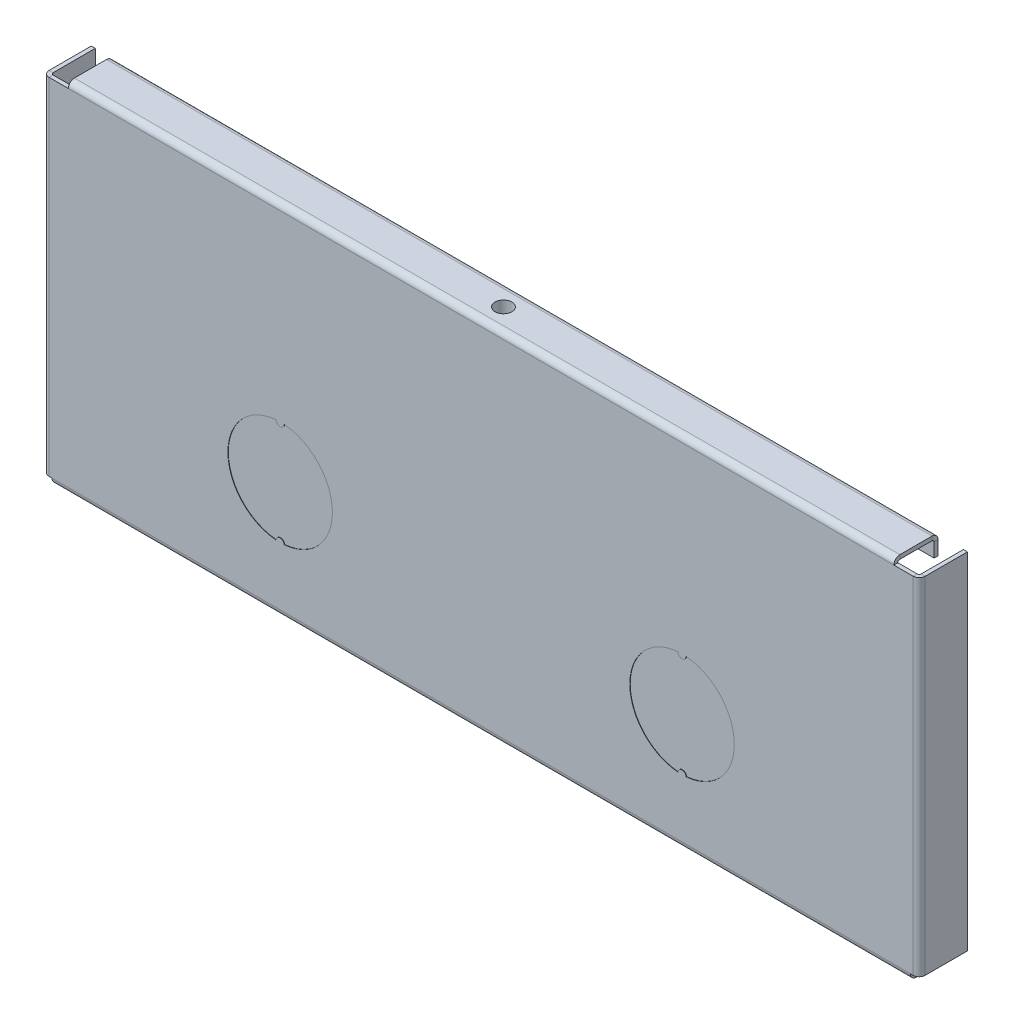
ISO-10303-21;
HEADER;
FILE_DESCRIPTION(('STEP AP214'),'2;1');
FILE_NAME('part.step','',(''),(''),'','','');
FILE_SCHEMA(('AUTOMOTIVE_DESIGN { 1 0 10303 214 1 1 1 1 }'));
ENDSEC;
DATA;
#1=APPLICATION_CONTEXT('core data for automotive mechanical design processes');
#2=APPLICATION_PROTOCOL_DEFINITION('international standard','automotive_design',2000,#1);
#3=PRODUCT_CONTEXT('',#1,'mechanical');
#4=PRODUCT('Part','Part','',(#3));
#5=PRODUCT_RELATED_PRODUCT_CATEGORY('part','',(#4));
#6=PRODUCT_DEFINITION_FORMATION('','',#4);
#7=PRODUCT_DEFINITION_CONTEXT('part definition',#1,'design');
#8=PRODUCT_DEFINITION('design','',#6,#7);
#9=PRODUCT_DEFINITION_SHAPE('','',#8);
#10=(LENGTH_UNIT() NAMED_UNIT(*) SI_UNIT(.MILLI.,.METRE.));
#11=(NAMED_UNIT(*) PLANE_ANGLE_UNIT() SI_UNIT($,.RADIAN.));
#12=(NAMED_UNIT(*) SI_UNIT($,.STERADIAN.) SOLID_ANGLE_UNIT());
#13=UNCERTAINTY_MEASURE_WITH_UNIT(LENGTH_MEASURE(1.E-05),#10,'distance_accuracy_value','');
#14=(GEOMETRIC_REPRESENTATION_CONTEXT(3) GLOBAL_UNCERTAINTY_ASSIGNED_CONTEXT((#13)) GLOBAL_UNIT_ASSIGNED_CONTEXT((#10,
#11,#12)) REPRESENTATION_CONTEXT('',''));
#15=CARTESIAN_POINT('',(0.,0.,0.));
#16=DIRECTION('',(0.,0.,1.));
#17=DIRECTION('',(1.,0.,0.));
#18=AXIS2_PLACEMENT_3D('',#15,#16,#17);
#19=CARTESIAN_POINT('',(0.,86.,-1.));
#20=DIRECTION('',(0.,0.,-1.));
#21=DIRECTION('',(-1.,0.,0.));
#22=AXIS2_PLACEMENT_3D('',#19,#20,#21);
#23=PLANE('',#22);
#24=DIRECTION('',(1.,0.,0.));
#25=VECTOR('',#24,1.);
#26=CARTESIAN_POINT('',(0.,0.,-1.));
#27=LINE('',#26,#25);
#28=CARTESIAN_POINT('',(1.5,0.,-1.));
#29=VERTEX_POINT('',#28);
#30=CARTESIAN_POINT('',(2.20000000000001,0.,-0.999999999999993));
#31=VERTEX_POINT('',#30);
#32=EDGE_CURVE('E623',#29,#31,#27,.T.);
#33=ORIENTED_EDGE('',*,*,#32,.F.);
#34=DIRECTION('',(0.,1.,0.));
#35=VECTOR('',#34,1.);
#36=CARTESIAN_POINT('',(1.5,86.,-1.));
#37=LINE('',#36,#35);
#38=CARTESIAN_POINT('',(1.5,86.,-1.));
#39=VERTEX_POINT('',#38);
#40=EDGE_CURVE('E488',#39,#29,#37,.F.);
#41=ORIENTED_EDGE('',*,*,#40,.F.);
#42=DIRECTION('',(-1.,0.,0.));
#43=VECTOR('',#42,1.);
#44=CARTESIAN_POINT('',(0.,86.,-1.));
#45=LINE('',#44,#43);
#46=CARTESIAN_POINT('',(6.3,86.,-1.00000000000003));
#47=VERTEX_POINT('',#46);
#48=EDGE_CURVE('E147',#47,#39,#45,.T.);
#49=ORIENTED_EDGE('',*,*,#48,.F.);
#50=DIRECTION('',(1.,0.,0.));
#51=VECTOR('',#50,1.);
#52=CARTESIAN_POINT('',(211.7,86.,-0.999999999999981));
#53=LINE('',#52,#51);
#54=CARTESIAN_POINT('',(211.7,86.,-0.999999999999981));
#55=VERTEX_POINT('',#54);
#56=EDGE_CURVE('E659',#55,#47,#53,.F.);
#57=ORIENTED_EDGE('',*,*,#56,.F.);
#58=CARTESIAN_POINT('',(216.5,86.,-1.));
#59=VERTEX_POINT('',#58);
#60=EDGE_CURVE('E13',#59,#55,#45,.T.);
#61=ORIENTED_EDGE('',*,*,#60,.F.);
#62=DIRECTION('',(0.,-1.,0.));
#63=VECTOR('',#62,1.);
#64=CARTESIAN_POINT('',(216.5,0.,-1.));
#65=LINE('',#64,#63);
#66=CARTESIAN_POINT('',(216.5,0.,-1.));
#67=VERTEX_POINT('',#66);
#68=EDGE_CURVE('E541',#67,#59,#65,.F.);
#69=ORIENTED_EDGE('',*,*,#68,.F.);
#70=CARTESIAN_POINT('',(215.8,0.,-0.999999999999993));
#71=VERTEX_POINT('',#70);
#72=EDGE_CURVE('E610',#71,#67,#27,.T.);
#73=ORIENTED_EDGE('',*,*,#72,.F.);
#74=DIRECTION('',(-1.,0.,0.));
#75=VECTOR('',#74,1.);
#76=CARTESIAN_POINT('',(2.20000000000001,0.,-0.999999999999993));
#77=LINE('',#76,#75);
#78=EDGE_CURVE('E599',#31,#71,#77,.F.);
#79=ORIENTED_EDGE('',*,*,#78,.F.);
#80=EDGE_LOOP('',(#33,#41,#49,#57,#61,#69,#73,#79));
#81=FACE_BOUND('',#80,.T.);
#82=ADVANCED_FACE('F138',(#81),#23,.T.);
#83=CARTESIAN_POINT('',(0.,86.,0.));
#84=DIRECTION('',(0.,0.,-1.));
#85=DIRECTION('',(-1.,0.,0.));
#86=AXIS2_PLACEMENT_3D('',#83,#84,#85);
#87=PLANE('',#86);
#88=CARTESIAN_POINT('',(159.,27.5,0.));
#89=DIRECTION('',(0.,0.,1.));
#90=DIRECTION('',(1.,0.,0.));
#91=AXIS2_PLACEMENT_3D('',#88,#89,#90);
#92=CIRCLE('',#91,13.);
#93=CARTESIAN_POINT('',(159.999470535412,14.5384777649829,0.));
#94=VERTEX_POINT('',#93);
#95=CARTESIAN_POINT('',(159.999992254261,40.4614819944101,0.));
#96=VERTEX_POINT('',#95);
#97=EDGE_CURVE('E404',#94,#96,#92,.T.);
#98=ORIENTED_EDGE('',*,*,#97,.F.);
#99=CARTESIAN_POINT('',(159.,14.505940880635,0.));
#100=DIRECTION('',(0.,0.,-1.));
#101=DIRECTION('',(1.,0.,0.));
#102=AXIS2_PLACEMENT_3D('',#99,#100,#101);
#103=CIRCLE('',#102,1.00000000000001);
#104=CARTESIAN_POINT('',(158.000529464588,14.5384777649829,0.));
#105=VERTEX_POINT('',#104);
#106=EDGE_CURVE('E155',#105,#94,#103,.T.);
#107=ORIENTED_EDGE('',*,*,#106,.F.);
#108=CARTESIAN_POINT('',(159.,27.5,0.));
#109=DIRECTION('',(0.,0.,1.));
#110=DIRECTION('',(1.,0.,0.));
#111=AXIS2_PLACEMENT_3D('',#108,#109,#110);
#112=CIRCLE('',#111,13.);
#113=CARTESIAN_POINT('',(158.000007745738,40.4614819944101,0.));
#114=VERTEX_POINT('',#113);
#115=EDGE_CURVE('E392',#114,#105,#112,.T.);
#116=ORIENTED_EDGE('',*,*,#115,.F.);
#117=CARTESIAN_POINT('',(159.,40.4575460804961,0.));
#118=DIRECTION('',(0.,0.,-1.));
#119=DIRECTION('',(1.,0.,0.));
#120=AXIS2_PLACEMENT_3D('',#117,#118,#119);
#121=CIRCLE('',#120,1.00000000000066);
#122=EDGE_CURVE('E395',#96,#114,#121,.T.);
#123=ORIENTED_EDGE('',*,*,#122,.F.);
#124=EDGE_LOOP('',(#98,#107,#116,#123));
#125=FACE_BOUND('',#124,.T.);
#126=CARTESIAN_POINT('',(59.,40.4575460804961,0.));
#127=DIRECTION('',(0.,0.,-1.));
#128=DIRECTION('',(1.,0.,0.));
#129=AXIS2_PLACEMENT_3D('',#126,#127,#128);
#130=CIRCLE('',#129,1.00000000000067);
#131=CARTESIAN_POINT('',(59.9999922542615,40.4614819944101,0.));
#132=VERTEX_POINT('',#131);
#133=CARTESIAN_POINT('',(58.0000077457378,40.4614819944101,0.));
#134=VERTEX_POINT('',#133);
#135=EDGE_CURVE('E428',#132,#134,#130,.T.);
#136=ORIENTED_EDGE('',*,*,#135,.F.);
#137=CARTESIAN_POINT('',(59.,27.5,0.));
#138=DIRECTION('',(0.,0.,1.));
#139=DIRECTION('',(1.,0.,0.));
#140=AXIS2_PLACEMENT_3D('',#137,#138,#139);
#141=CIRCLE('',#140,13.);
#142=CARTESIAN_POINT('',(59.9994705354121,14.5384777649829,0.));
#143=VERTEX_POINT('',#142);
#144=EDGE_CURVE('E163',#143,#132,#141,.T.);
#145=ORIENTED_EDGE('',*,*,#144,.F.);
#146=CARTESIAN_POINT('',(59.,14.505940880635,0.));
#147=DIRECTION('',(0.,0.,-1.));
#148=DIRECTION('',(1.,0.,0.));
#149=AXIS2_PLACEMENT_3D('',#146,#147,#148);
#150=CIRCLE('',#149,1.);
#151=CARTESIAN_POINT('',(58.0005294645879,14.5384777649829,0.));
#152=VERTEX_POINT('',#151);
#153=EDGE_CURVE('E417',#152,#143,#150,.T.);
#154=ORIENTED_EDGE('',*,*,#153,.F.);
#155=CARTESIAN_POINT('',(59.,27.5,0.));
#156=DIRECTION('',(0.,0.,1.));
#157=DIRECTION('',(1.,0.,0.));
#158=AXIS2_PLACEMENT_3D('',#155,#156,#157);
#159=CIRCLE('',#158,13.);
#160=EDGE_CURVE('E431',#134,#152,#159,.T.);
#161=ORIENTED_EDGE('',*,*,#160,.F.);
#162=EDGE_LOOP('',(#136,#145,#154,#161));
#163=FACE_BOUND('',#162,.T.);
#164=DIRECTION('',(0.,1.,0.));
#165=VECTOR('',#164,1.);
#166=CARTESIAN_POINT('',(1.5,86.,0.));
#167=LINE('',#166,#165);
#168=CARTESIAN_POINT('',(1.5,86.,0.));
#169=VERTEX_POINT('',#168);
#170=CARTESIAN_POINT('',(1.5,0.,0.));
#171=VERTEX_POINT('',#170);
#172=EDGE_CURVE('E476',#169,#171,#167,.F.);
#173=ORIENTED_EDGE('',*,*,#172,.T.);
#174=DIRECTION('',(1.,0.,0.));
#175=VECTOR('',#174,1.);
#176=CARTESIAN_POINT('',(0.,0.,0.));
#177=LINE('',#176,#175);
#178=CARTESIAN_POINT('',(2.20000000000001,0.,0.));
#179=VERTEX_POINT('',#178);
#180=EDGE_CURVE('E620',#171,#179,#177,.T.);
#181=ORIENTED_EDGE('',*,*,#180,.T.);
#182=DIRECTION('',(-1.,0.,0.));
#183=VECTOR('',#182,1.);
#184=CARTESIAN_POINT('',(2.20000000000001,0.,0.));
#185=LINE('',#184,#183);
#186=CARTESIAN_POINT('',(215.8,0.,0.));
#187=VERTEX_POINT('',#186);
#188=EDGE_CURVE('E605',#179,#187,#185,.F.);
#189=ORIENTED_EDGE('',*,*,#188,.T.);
#190=CARTESIAN_POINT('',(216.5,0.,0.));
#191=VERTEX_POINT('',#190);
#192=EDGE_CURVE('E637',#187,#191,#177,.T.);
#193=ORIENTED_EDGE('',*,*,#192,.T.);
#194=DIRECTION('',(0.,-1.,0.));
#195=VECTOR('',#194,1.);
#196=CARTESIAN_POINT('',(216.5,0.,0.));
#197=LINE('',#196,#195);
#198=CARTESIAN_POINT('',(216.5,86.,0.));
#199=VERTEX_POINT('',#198);
#200=EDGE_CURVE('E529',#191,#199,#197,.F.);
#201=ORIENTED_EDGE('',*,*,#200,.T.);
#202=DIRECTION('',(-1.,0.,0.));
#203=VECTOR('',#202,1.);
#204=CARTESIAN_POINT('',(0.,86.,0.));
#205=LINE('',#204,#203);
#206=CARTESIAN_POINT('',(211.7,86.,0.));
#207=VERTEX_POINT('',#206);
#208=EDGE_CURVE('E608',#199,#207,#205,.T.);
#209=ORIENTED_EDGE('',*,*,#208,.T.);
#210=DIRECTION('',(1.,0.,0.));
#211=VECTOR('',#210,1.);
#212=CARTESIAN_POINT('',(211.7,86.,0.));
#213=LINE('',#212,#211);
#214=CARTESIAN_POINT('',(6.3,86.,0.));
#215=VERTEX_POINT('',#214);
#216=EDGE_CURVE('E654',#207,#215,#213,.F.);
#217=ORIENTED_EDGE('',*,*,#216,.T.);
#218=EDGE_CURVE('E611',#215,#169,#205,.T.);
#219=ORIENTED_EDGE('',*,*,#218,.T.);
#220=EDGE_LOOP('',(#173,#181,#189,#193,#201,#209,#217,#219));
#221=FACE_BOUND('',#220,.T.);
#222=ADVANCED_FACE('F811',(#125,#163,#221),#87,.F.);
#223=CARTESIAN_POINT('',(0.,86.,-1.));
#224=DIRECTION('',(0.,1.,0.));
#225=DIRECTION('',(0.,0.,1.));
#226=AXIS2_PLACEMENT_3D('',#223,#224,#225);
#227=PLANE('',#226);
#228=ORIENTED_EDGE('',*,*,#48,.T.);
#229=DIRECTION('',(0.,0.,1.));
#230=VECTOR('',#229,1.);
#231=CARTESIAN_POINT('',(1.5,86.,-1.));
#232=LINE('',#231,#230);
#233=EDGE_CURVE('E482',#39,#169,#232,.T.);
#234=ORIENTED_EDGE('',*,*,#233,.T.);
#235=ORIENTED_EDGE('',*,*,#218,.F.);
#236=DIRECTION('',(0.,0.,1.));
#237=VECTOR('',#236,1.);
#238=CARTESIAN_POINT('',(6.3,86.,-1.00000000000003));
#239=LINE('',#238,#237);
#240=EDGE_CURVE('E643',#47,#215,#239,.T.);
#241=ORIENTED_EDGE('',*,*,#240,.F.);
#242=EDGE_LOOP('',(#228,#234,#235,#241));
#243=FACE_BOUND('',#242,.T.);
#244=ADVANCED_FACE('F817',(#243),#227,.T.);
#245=CARTESIAN_POINT('',(0.,0.,-1.));
#246=DIRECTION('',(0.,-1.,0.));
#247=DIRECTION('',(0.,0.,-1.));
#248=AXIS2_PLACEMENT_3D('',#245,#246,#247);
#249=PLANE('',#248);
#250=ORIENTED_EDGE('',*,*,#72,.T.);
#251=DIRECTION('',(0.,0.,1.));
#252=VECTOR('',#251,1.);
#253=CARTESIAN_POINT('',(216.5,0.,-1.));
#254=LINE('',#253,#252);
#255=EDGE_CURVE('E535',#67,#191,#254,.T.);
#256=ORIENTED_EDGE('',*,*,#255,.T.);
#257=ORIENTED_EDGE('',*,*,#192,.F.);
#258=DIRECTION('',(0.,0.,1.));
#259=VECTOR('',#258,1.);
#260=CARTESIAN_POINT('',(215.8,0.,-0.999999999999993));
#261=LINE('',#260,#259);
#262=EDGE_CURVE('E588',#71,#187,#261,.T.);
#263=ORIENTED_EDGE('',*,*,#262,.F.);
#264=EDGE_LOOP('',(#250,#256,#257,#263));
#265=FACE_BOUND('',#264,.T.);
#266=ADVANCED_FACE('F140',(#265),#249,.T.);
#267=DIRECTION('',(0.,0.,1.));
#268=VECTOR('',#267,1.);
#269=CARTESIAN_POINT('',(1.5,0.,-1.));
#270=LINE('',#269,#268);
#271=EDGE_CURVE('E493',#29,#171,#270,.T.);
#272=ORIENTED_EDGE('',*,*,#271,.F.);
#273=ORIENTED_EDGE('',*,*,#32,.T.);
#274=DIRECTION('',(0.,0.,1.));
#275=VECTOR('',#274,1.);
#276=CARTESIAN_POINT('',(2.20000000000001,0.,-0.999999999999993));
#277=LINE('',#276,#275);
#278=EDGE_CURVE('E592',#31,#179,#277,.T.);
#279=ORIENTED_EDGE('',*,*,#278,.T.);
#280=ORIENTED_EDGE('',*,*,#180,.F.);
#281=EDGE_LOOP('',(#272,#273,#279,#280));
#282=FACE_BOUND('',#281,.T.);
#283=ADVANCED_FACE('F829',(#282),#249,.T.);
#284=CARTESIAN_POINT('',(211.7,87.5,-0.999999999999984));
#285=DIRECTION('',(1.,0.,0.));
#286=DIRECTION('',(0.,0.,-1.));
#287=AXIS2_PLACEMENT_3D('',#284,#285,#286);
#288=PLANE('',#287);
#289=DIRECTION('',(0.,0.,-1.));
#290=VECTOR('',#289,1.);
#291=CARTESIAN_POINT('',(211.7,86.5,-0.999999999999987));
#292=LINE('',#291,#290);
#293=CARTESIAN_POINT('',(211.7,86.5,-9.5));
#294=VERTEX_POINT('',#293);
#295=CARTESIAN_POINT('',(211.7,86.5,-1.49999999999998));
#296=VERTEX_POINT('',#295);
#297=EDGE_CURVE('E681',#294,#296,#292,.F.);
#298=ORIENTED_EDGE('',*,*,#297,.F.);
#299=DIRECTION('',(0.,1.,0.));
#300=VECTOR('',#299,1.);
#301=CARTESIAN_POINT('',(211.7,86.5,-9.5));
#302=LINE('',#301,#300);
#303=CARTESIAN_POINT('',(211.7,87.5,-9.5));
#304=VERTEX_POINT('',#303);
#305=EDGE_CURVE('E689',#294,#304,#302,.T.);
#306=ORIENTED_EDGE('',*,*,#305,.T.);
#307=DIRECTION('',(0.,0.,1.));
#308=VECTOR('',#307,1.);
#309=CARTESIAN_POINT('',(211.7,87.5,-0.999999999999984));
#310=LINE('',#309,#308);
#311=CARTESIAN_POINT('',(211.7,87.5,-1.49999999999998));
#312=VERTEX_POINT('',#311);
#313=EDGE_CURVE('E686',#304,#312,#310,.T.);
#314=ORIENTED_EDGE('',*,*,#313,.T.);
#315=DIRECTION('',(0.,1.,0.));
#316=VECTOR('',#315,1.);
#317=CARTESIAN_POINT('',(211.7,86.5,-1.49999999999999));
#318=LINE('',#317,#316);
#319=EDGE_CURVE('E672',#296,#312,#318,.T.);
#320=ORIENTED_EDGE('',*,*,#319,.F.);
#321=EDGE_LOOP('',(#298,#306,#314,#320));
#322=FACE_BOUND('',#321,.T.);
#323=ADVANCED_FACE('F774',(#322),#288,.T.);
#324=CARTESIAN_POINT('',(211.7,87.5,-0.999999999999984));
#325=DIRECTION('',(0.,1.,0.));
#326=DIRECTION('',(0.,0.,1.));
#327=AXIS2_PLACEMENT_3D('',#324,#325,#326);
#328=PLANE('',#327);
#329=CARTESIAN_POINT('',(109.,87.5000000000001,-5.55885691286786));
#330=DIRECTION('',(0.,1.,0.));
#331=DIRECTION('',(0.,0.,1.));
#332=AXIS2_PLACEMENT_3D('',#329,#330,#331);
#333=CIRCLE('',#332,2.1);
#334=CARTESIAN_POINT('',(109.,87.5,-3.45885691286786));
#335=VERTEX_POINT('',#334);
#336=EDGE_CURVE('E1339',#335,#335,#333,.T.);
#337=ORIENTED_EDGE('',*,*,#336,.F.);
#338=EDGE_LOOP('',(#337));
#339=FACE_BOUND('',#338,.T.);
#340=ORIENTED_EDGE('',*,*,#313,.F.);
#341=DIRECTION('',(1.,0.,0.));
#342=VECTOR('',#341,1.);
#343=CARTESIAN_POINT('',(211.7,87.5,-9.5));
#344=LINE('',#343,#342);
#345=CARTESIAN_POINT('',(6.3,87.5,-9.5));
#346=VERTEX_POINT('',#345);
#347=EDGE_CURVE('E707',#304,#346,#344,.F.);
#348=ORIENTED_EDGE('',*,*,#347,.T.);
#349=DIRECTION('',(0.,0.,-1.));
#350=VECTOR('',#349,1.);
#351=CARTESIAN_POINT('',(6.3,87.5,-11.));
#352=LINE('',#351,#350);
#353=CARTESIAN_POINT('',(6.3,87.5,-1.50000000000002));
#354=VERTEX_POINT('',#353);
#355=EDGE_CURVE('E683',#354,#346,#352,.T.);
#356=ORIENTED_EDGE('',*,*,#355,.F.);
#357=DIRECTION('',(1.,0.,0.));
#358=VECTOR('',#357,1.);
#359=CARTESIAN_POINT('',(211.7,87.5,-1.49999999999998));
#360=LINE('',#359,#358);
#361=EDGE_CURVE('E675',#354,#312,#360,.T.);
#362=ORIENTED_EDGE('',*,*,#361,.T.);
#363=EDGE_LOOP('',(#340,#348,#356,#362));
#364=FACE_BOUND('',#363,.T.);
#365=ADVANCED_FACE('F786',(#339,#364),#328,.T.);
#366=CARTESIAN_POINT('',(211.7,86.5,-0.999999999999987));
#367=DIRECTION('',(0.,1.,0.));
#368=DIRECTION('',(0.,0.,1.));
#369=AXIS2_PLACEMENT_3D('',#366,#367,#368);
#370=PLANE('',#369);
#371=CARTESIAN_POINT('',(109.,86.5,-5.55885691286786));
#372=DIRECTION('',(0.,1.,0.));
#373=DIRECTION('',(0.,0.,1.));
#374=AXIS2_PLACEMENT_3D('',#371,#372,#373);
#375=CIRCLE('',#374,3.4);
#376=CARTESIAN_POINT('',(109.,86.5,-2.15885691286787));
#377=VERTEX_POINT('',#376);
#378=EDGE_CURVE('E142',#377,#377,#375,.T.);
#379=ORIENTED_EDGE('',*,*,#378,.T.);
#380=EDGE_LOOP('',(#379));
#381=FACE_BOUND('',#380,.T.);
#382=DIRECTION('',(1.,0.,0.));
#383=VECTOR('',#382,1.);
#384=CARTESIAN_POINT('',(211.7,86.5,-9.5));
#385=LINE('',#384,#383);
#386=CARTESIAN_POINT('',(6.3,86.5,-9.5));
#387=VERTEX_POINT('',#386);
#388=EDGE_CURVE('E698',#294,#387,#385,.F.);
#389=ORIENTED_EDGE('',*,*,#388,.F.);
#390=ORIENTED_EDGE('',*,*,#297,.T.);
#391=DIRECTION('',(-1.,0.,0.));
#392=VECTOR('',#391,1.);
#393=CARTESIAN_POINT('',(6.3,86.5,-1.50000000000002));
#394=LINE('',#393,#392);
#395=CARTESIAN_POINT('',(6.3,86.5,-1.50000000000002));
#396=VERTEX_POINT('',#395);
#397=EDGE_CURVE('E668',#396,#296,#394,.F.);
#398=ORIENTED_EDGE('',*,*,#397,.F.);
#399=DIRECTION('',(0.,0.,1.));
#400=VECTOR('',#399,1.);
#401=CARTESIAN_POINT('',(6.3,86.5,-0.999999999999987));
#402=LINE('',#401,#400);
#403=EDGE_CURVE('E678',#396,#387,#402,.F.);
#404=ORIENTED_EDGE('',*,*,#403,.T.);
#405=EDGE_LOOP('',(#389,#390,#398,#404));
#406=FACE_BOUND('',#405,.T.);
#407=ADVANCED_FACE('F768',(#381,#406),#370,.F.);
#408=DIRECTION('',(0.,0.,1.));
#409=VECTOR('',#408,1.);
#410=CARTESIAN_POINT('',(216.5,86.,-1.));
#411=LINE('',#410,#409);
#412=EDGE_CURVE('E546',#59,#199,#411,.T.);
#413=ORIENTED_EDGE('',*,*,#412,.F.);
#414=ORIENTED_EDGE('',*,*,#60,.T.);
#415=DIRECTION('',(0.,0.,1.));
#416=VECTOR('',#415,1.);
#417=CARTESIAN_POINT('',(211.7,86.,-0.999999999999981));
#418=LINE('',#417,#416);
#419=EDGE_CURVE('E646',#55,#207,#418,.T.);
#420=ORIENTED_EDGE('',*,*,#419,.T.);
#421=ORIENTED_EDGE('',*,*,#208,.F.);
#422=EDGE_LOOP('',(#413,#414,#420,#421));
#423=FACE_BOUND('',#422,.T.);
#424=ADVANCED_FACE('F825',(#423),#227,.T.);
#425=CARTESIAN_POINT('',(6.3,86.,-1.50000000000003));
#426=DIRECTION('',(-1.,0.,0.));
#427=DIRECTION('',(0.,0.,1.));
#428=AXIS2_PLACEMENT_3D('',#425,#426,#427);
#429=PLANE('',#428);
#430=DIRECTION('',(0.,1.,0.));
#431=VECTOR('',#430,1.);
#432=CARTESIAN_POINT('',(6.3,87.5,-1.50000000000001));
#433=LINE('',#432,#431);
#434=EDGE_CURVE('E665',#396,#354,#433,.T.);
#435=ORIENTED_EDGE('',*,*,#434,.F.);
#436=CARTESIAN_POINT('',(6.3,86.,-1.50000000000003));
#437=DIRECTION('',(1.,0.,0.));
#438=DIRECTION('',(0.,0.,-1.));
#439=AXIS2_PLACEMENT_3D('',#436,#437,#438);
#440=CIRCLE('',#439,0.5);
#441=EDGE_CURVE('E657',#47,#396,#440,.F.);
#442=ORIENTED_EDGE('',*,*,#441,.F.);
#443=ORIENTED_EDGE('',*,*,#240,.T.);
#444=CARTESIAN_POINT('',(6.3,86.,-1.50000000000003));
#445=DIRECTION('',(1.,0.,0.));
#446=DIRECTION('',(0.,0.,-1.));
#447=AXIS2_PLACEMENT_3D('',#444,#445,#446);
#448=CIRCLE('',#447,1.5);
#449=EDGE_CURVE('E651',#215,#354,#448,.F.);
#450=ORIENTED_EDGE('',*,*,#449,.T.);
#451=EDGE_LOOP('',(#435,#442,#443,#450));
#452=FACE_BOUND('',#451,.T.);
#453=ADVANCED_FACE('F792',(#452),#429,.T.);
#454=CARTESIAN_POINT('',(211.7,86.,-1.49999999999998));
#455=DIRECTION('',(-1.,0.,0.));
#456=DIRECTION('',(0.,0.,1.));
#457=AXIS2_PLACEMENT_3D('',#454,#455,#456);
#458=PLANE('',#457);
#459=CARTESIAN_POINT('',(211.7,86.,-1.49999999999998));
#460=DIRECTION('',(1.,0.,0.));
#461=DIRECTION('',(0.,0.,-1.));
#462=AXIS2_PLACEMENT_3D('',#459,#460,#461);
#463=CIRCLE('',#462,0.5);
#464=EDGE_CURVE('E688',#296,#55,#463,.T.);
#465=ORIENTED_EDGE('',*,*,#464,.F.);
#466=ORIENTED_EDGE('',*,*,#319,.T.);
#467=CARTESIAN_POINT('',(211.7,86.,-1.49999999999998));
#468=DIRECTION('',(1.,0.,0.));
#469=DIRECTION('',(0.,0.,-1.));
#470=AXIS2_PLACEMENT_3D('',#467,#468,#469);
#471=CIRCLE('',#470,1.5);
#472=EDGE_CURVE('E624',#312,#207,#471,.T.);
#473=ORIENTED_EDGE('',*,*,#472,.T.);
#474=ORIENTED_EDGE('',*,*,#419,.F.);
#475=EDGE_LOOP('',(#465,#466,#473,#474));
#476=FACE_BOUND('',#475,.T.);
#477=ADVANCED_FACE('F780',(#476),#458,.F.);
#478=CARTESIAN_POINT('',(211.7,86.,-1.49999999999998));
#479=DIRECTION('',(1.,0.,0.));
#480=DIRECTION('',(0.,1.,0.));
#481=AXIS2_PLACEMENT_3D('',#478,#479,#480);
#482=CYLINDRICAL_SURFACE('',#481,1.5);
#483=ORIENTED_EDGE('',*,*,#216,.F.);
#484=ORIENTED_EDGE('',*,*,#472,.F.);
#485=ORIENTED_EDGE('',*,*,#361,.F.);
#486=ORIENTED_EDGE('',*,*,#449,.F.);
#487=EDGE_LOOP('',(#483,#484,#485,#486));
#488=FACE_BOUND('',#487,.T.);
#489=ADVANCED_FACE('F789',(#488),#482,.T.);
#490=CARTESIAN_POINT('',(211.7,86.,-1.49999999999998));
#491=DIRECTION('',(1.,0.,0.));
#492=DIRECTION('',(0.,1.,0.));
#493=AXIS2_PLACEMENT_3D('',#490,#491,#492);
#494=CYLINDRICAL_SURFACE('',#493,0.5);
#495=ORIENTED_EDGE('',*,*,#56,.T.);
#496=ORIENTED_EDGE('',*,*,#441,.T.);
#497=ORIENTED_EDGE('',*,*,#397,.T.);
#498=ORIENTED_EDGE('',*,*,#464,.T.);
#499=EDGE_LOOP('',(#495,#496,#497,#498));
#500=FACE_BOUND('',#499,.T.);
#501=ADVANCED_FACE('F1359',(#500),#494,.F.);
#502=CARTESIAN_POINT('',(6.3,87.5,-11.));
#503=DIRECTION('',(-1.,0.,0.));
#504=DIRECTION('',(0.,0.,1.));
#505=AXIS2_PLACEMENT_3D('',#502,#503,#504);
#506=PLANE('',#505);
#507=DIRECTION('',(0.,1.,0.));
#508=VECTOR('',#507,1.);
#509=CARTESIAN_POINT('',(6.3,86.5,-9.5));
#510=LINE('',#509,#508);
#511=EDGE_CURVE('E669',#387,#346,#510,.T.);
#512=ORIENTED_EDGE('',*,*,#511,.F.);
#513=ORIENTED_EDGE('',*,*,#403,.F.);
#514=ORIENTED_EDGE('',*,*,#434,.T.);
#515=ORIENTED_EDGE('',*,*,#355,.T.);
#516=EDGE_LOOP('',(#512,#513,#514,#515));
#517=FACE_BOUND('',#516,.T.);
#518=ADVANCED_FACE('F796',(#517),#506,.T.);
#519=CARTESIAN_POINT('',(6.3,86.,-9.50000000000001));
#520=DIRECTION('',(-1.,0.,0.));
#521=DIRECTION('',(0.,0.,1.));
#522=AXIS2_PLACEMENT_3D('',#519,#520,#521);
#523=PLANE('',#522);
#524=DIRECTION('',(0.,0.,1.));
#525=VECTOR('',#524,1.);
#526=CARTESIAN_POINT('',(6.3,86.,-11.));
#527=LINE('',#526,#525);
#528=CARTESIAN_POINT('',(6.3,86.,-10.));
#529=VERTEX_POINT('',#528);
#530=CARTESIAN_POINT('',(6.3,86.,-11.));
#531=VERTEX_POINT('',#530);
#532=EDGE_CURVE('E591',#529,#531,#527,.F.);
#533=ORIENTED_EDGE('',*,*,#532,.F.);
#534=CARTESIAN_POINT('',(6.3,86.,-9.50000000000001));
#535=DIRECTION('',(1.,0.,0.));
#536=DIRECTION('',(0.,0.,-1.));
#537=AXIS2_PLACEMENT_3D('',#534,#535,#536);
#538=CIRCLE('',#537,0.5);
#539=EDGE_CURVE('E701',#387,#529,#538,.F.);
#540=ORIENTED_EDGE('',*,*,#539,.F.);
#541=ORIENTED_EDGE('',*,*,#511,.T.);
#542=CARTESIAN_POINT('',(6.3,86.,-9.50000000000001));
#543=DIRECTION('',(1.,0.,0.));
#544=DIRECTION('',(0.,0.,-1.));
#545=AXIS2_PLACEMENT_3D('',#542,#543,#544);
#546=CIRCLE('',#545,1.5);
#547=EDGE_CURVE('E692',#346,#531,#546,.F.);
#548=ORIENTED_EDGE('',*,*,#547,.T.);
#549=EDGE_LOOP('',(#533,#540,#541,#548));
#550=FACE_BOUND('',#549,.T.);
#551=ADVANCED_FACE('F798',(#550),#523,.T.);
#552=CARTESIAN_POINT('',(211.7,86.,-9.50000000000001));
#553=DIRECTION('',(-1.,0.,0.));
#554=DIRECTION('',(0.,0.,1.));
#555=AXIS2_PLACEMENT_3D('',#552,#553,#554);
#556=PLANE('',#555);
#557=CARTESIAN_POINT('',(211.7,86.,-9.50000000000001));
#558=DIRECTION('',(1.,0.,0.));
#559=DIRECTION('',(0.,0.,-1.));
#560=AXIS2_PLACEMENT_3D('',#557,#558,#559);
#561=CIRCLE('',#560,0.5);
#562=CARTESIAN_POINT('',(211.7,86.,-10.));
#563=VERTEX_POINT('',#562);
#564=EDGE_CURVE('E695',#563,#294,#561,.T.);
#565=ORIENTED_EDGE('',*,*,#564,.F.);
#566=DIRECTION('',(0.,0.,1.));
#567=VECTOR('',#566,1.);
#568=CARTESIAN_POINT('',(211.7,86.,-10.));
#569=LINE('',#568,#567);
#570=CARTESIAN_POINT('',(211.7,86.,-11.));
#571=VERTEX_POINT('',#570);
#572=EDGE_CURVE('E716',#563,#571,#569,.F.);
#573=ORIENTED_EDGE('',*,*,#572,.T.);
#574=CARTESIAN_POINT('',(211.7,86.,-9.50000000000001));
#575=DIRECTION('',(1.,0.,0.));
#576=DIRECTION('',(0.,0.,-1.));
#577=AXIS2_PLACEMENT_3D('',#574,#575,#576);
#578=CIRCLE('',#577,1.5);
#579=EDGE_CURVE('E704',#571,#304,#578,.T.);
#580=ORIENTED_EDGE('',*,*,#579,.T.);
#581=ORIENTED_EDGE('',*,*,#305,.F.);
#582=EDGE_LOOP('',(#565,#573,#580,#581));
#583=FACE_BOUND('',#582,.T.);
#584=ADVANCED_FACE('F761',(#583),#556,.F.);
#585=CARTESIAN_POINT('',(211.7,86.,-9.50000000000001));
#586=DIRECTION('',(1.,0.,0.));
#587=DIRECTION('',(0.,0.,-1.));
#588=AXIS2_PLACEMENT_3D('',#585,#586,#587);
#589=CYLINDRICAL_SURFACE('',#588,1.5);
#590=ORIENTED_EDGE('',*,*,#347,.F.);
#591=ORIENTED_EDGE('',*,*,#579,.F.);
#592=DIRECTION('',(1.,0.,0.));
#593=VECTOR('',#592,1.);
#594=CARTESIAN_POINT('',(6.3,86.,-11.));
#595=LINE('',#594,#593);
#596=EDGE_CURVE('E719',#531,#571,#595,.T.);
#597=ORIENTED_EDGE('',*,*,#596,.F.);
#598=ORIENTED_EDGE('',*,*,#547,.F.);
#599=EDGE_LOOP('',(#590,#591,#597,#598));
#600=FACE_BOUND('',#599,.T.);
#601=ADVANCED_FACE('F800',(#600),#589,.T.);
#602=CARTESIAN_POINT('',(211.7,86.,-9.50000000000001));
#603=DIRECTION('',(1.,0.,0.));
#604=DIRECTION('',(0.,0.,-1.));
#605=AXIS2_PLACEMENT_3D('',#602,#603,#604);
#606=CYLINDRICAL_SURFACE('',#605,0.5);
#607=ORIENTED_EDGE('',*,*,#388,.T.);
#608=ORIENTED_EDGE('',*,*,#539,.T.);
#609=DIRECTION('',(-1.,0.,0.));
#610=VECTOR('',#609,1.);
#611=CARTESIAN_POINT('',(6.3,86.,-10.));
#612=LINE('',#611,#610);
#613=EDGE_CURVE('E714',#529,#563,#612,.F.);
#614=ORIENTED_EDGE('',*,*,#613,.T.);
#615=ORIENTED_EDGE('',*,*,#564,.T.);
#616=EDGE_LOOP('',(#607,#608,#614,#615));
#617=FACE_BOUND('',#616,.T.);
#618=ADVANCED_FACE('F764',(#617),#606,.F.);
#619=CARTESIAN_POINT('',(6.3,82.5,-11.));
#620=DIRECTION('',(1.,0.,0.));
#621=DIRECTION('',(0.,1.,0.));
#622=AXIS2_PLACEMENT_3D('',#619,#620,#621);
#623=PLANE('',#622);
#624=ORIENTED_EDGE('',*,*,#532,.T.);
#625=DIRECTION('',(0.,-1.,0.));
#626=VECTOR('',#625,1.);
#627=CARTESIAN_POINT('',(6.3,86.5,-11.));
#628=LINE('',#627,#626);
#629=CARTESIAN_POINT('',(6.3,82.5,-11.));
#630=VERTEX_POINT('',#629);
#631=EDGE_CURVE('E729',#630,#531,#628,.F.);
#632=ORIENTED_EDGE('',*,*,#631,.F.);
#633=DIRECTION('',(0.,0.,1.));
#634=VECTOR('',#633,1.);
#635=CARTESIAN_POINT('',(6.3,82.5,-11.));
#636=LINE('',#635,#634);
#637=CARTESIAN_POINT('',(6.3,82.5,-10.));
#638=VERTEX_POINT('',#637);
#639=EDGE_CURVE('E736',#630,#638,#636,.T.);
#640=ORIENTED_EDGE('',*,*,#639,.T.);
#641=DIRECTION('',(0.,1.,0.));
#642=VECTOR('',#641,1.);
#643=CARTESIAN_POINT('',(6.3,82.5,-10.));
#644=LINE('',#643,#642);
#645=EDGE_CURVE('E722',#638,#529,#644,.T.);
#646=ORIENTED_EDGE('',*,*,#645,.T.);
#647=EDGE_LOOP('',(#624,#632,#640,#646));
#648=FACE_BOUND('',#647,.T.);
#649=ADVANCED_FACE('F754',(#648),#623,.F.);
#650=CARTESIAN_POINT('',(211.7,86.5,-11.));
#651=DIRECTION('',(-1.,0.,0.));
#652=DIRECTION('',(0.,0.,1.));
#653=AXIS2_PLACEMENT_3D('',#650,#651,#652);
#654=PLANE('',#653);
#655=ORIENTED_EDGE('',*,*,#572,.F.);
#656=DIRECTION('',(0.,-1.,0.));
#657=VECTOR('',#656,1.);
#658=CARTESIAN_POINT('',(211.7,86.5,-10.));
#659=LINE('',#658,#657);
#660=CARTESIAN_POINT('',(211.7,82.5,-10.));
#661=VERTEX_POINT('',#660);
#662=EDGE_CURVE('E725',#563,#661,#659,.T.);
#663=ORIENTED_EDGE('',*,*,#662,.T.);
#664=DIRECTION('',(0.,0.,1.));
#665=VECTOR('',#664,1.);
#666=CARTESIAN_POINT('',(211.7,82.5,-11.));
#667=LINE('',#666,#665);
#668=CARTESIAN_POINT('',(211.7,82.5,-11.));
#669=VERTEX_POINT('',#668);
#670=EDGE_CURVE('E699',#669,#661,#667,.T.);
#671=ORIENTED_EDGE('',*,*,#670,.F.);
#672=DIRECTION('',(0.,1.,0.));
#673=VECTOR('',#672,1.);
#674=CARTESIAN_POINT('',(211.7,86.5,-11.));
#675=LINE('',#674,#673);
#676=EDGE_CURVE('E732',#571,#669,#675,.F.);
#677=ORIENTED_EDGE('',*,*,#676,.F.);
#678=EDGE_LOOP('',(#655,#663,#671,#677));
#679=FACE_BOUND('',#678,.T.);
#680=ADVANCED_FACE('F758',(#679),#654,.F.);
#681=CARTESIAN_POINT('',(6.3,86.5,-11.));
#682=DIRECTION('',(0.,0.,-1.));
#683=DIRECTION('',(0.,1.,0.));
#684=AXIS2_PLACEMENT_3D('',#681,#682,#683);
#685=PLANE('',#684);
#686=ORIENTED_EDGE('',*,*,#631,.T.);
#687=ORIENTED_EDGE('',*,*,#596,.T.);
#688=ORIENTED_EDGE('',*,*,#676,.T.);
#689=DIRECTION('',(1.,0.,0.));
#690=VECTOR('',#689,1.);
#691=CARTESIAN_POINT('',(6.3,82.5,-11.));
#692=LINE('',#691,#690);
#693=EDGE_CURVE('E734',#669,#630,#692,.F.);
#694=ORIENTED_EDGE('',*,*,#693,.T.);
#695=EDGE_LOOP('',(#686,#687,#688,#694));
#696=FACE_BOUND('',#695,.T.);
#697=ADVANCED_FACE('F757',(#696),#685,.T.);
#698=CARTESIAN_POINT('',(6.3,86.5,-10.));
#699=DIRECTION('',(0.,0.,-1.));
#700=DIRECTION('',(0.,1.,0.));
#701=AXIS2_PLACEMENT_3D('',#698,#699,#700);
#702=PLANE('',#701);
#703=ORIENTED_EDGE('',*,*,#613,.F.);
#704=ORIENTED_EDGE('',*,*,#645,.F.);
#705=DIRECTION('',(-1.,0.,0.));
#706=VECTOR('',#705,1.);
#707=CARTESIAN_POINT('',(211.7,82.5,-10.));
#708=LINE('',#707,#706);
#709=EDGE_CURVE('E727',#661,#638,#708,.T.);
#710=ORIENTED_EDGE('',*,*,#709,.F.);
#711=ORIENTED_EDGE('',*,*,#662,.F.);
#712=EDGE_LOOP('',(#703,#704,#710,#711));
#713=FACE_BOUND('',#712,.T.);
#714=ADVANCED_FACE('F751',(#713),#702,.F.);
#715=CARTESIAN_POINT('',(211.7,82.5,-11.));
#716=DIRECTION('',(0.,1.,0.));
#717=DIRECTION('',(0.,0.,1.));
#718=AXIS2_PLACEMENT_3D('',#715,#716,#717);
#719=PLANE('',#718);
#720=ORIENTED_EDGE('',*,*,#709,.T.);
#721=ORIENTED_EDGE('',*,*,#639,.F.);
#722=ORIENTED_EDGE('',*,*,#693,.F.);
#723=ORIENTED_EDGE('',*,*,#670,.T.);
#724=EDGE_LOOP('',(#720,#721,#722,#723));
#725=FACE_BOUND('',#724,.T.);
#726=ADVANCED_FACE('F743',(#725),#719,.F.);
#727=CARTESIAN_POINT('',(215.8,0.,-1.49999999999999));
#728=DIRECTION('',(1.,0.,0.));
#729=DIRECTION('',(0.,0.,-1.));
#730=AXIS2_PLACEMENT_3D('',#727,#728,#729);
#731=PLANE('',#730);
#732=DIRECTION('',(0.,-1.,0.));
#733=VECTOR('',#732,1.);
#734=CARTESIAN_POINT('',(215.8,-1.5,-1.49999999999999));
#735=LINE('',#734,#733);
#736=CARTESIAN_POINT('',(215.8,-0.5,-1.49999999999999));
#737=VERTEX_POINT('',#736);
#738=CARTESIAN_POINT('',(215.8,-1.5,-1.49999999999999));
#739=VERTEX_POINT('',#738);
#740=EDGE_CURVE('E549',#737,#739,#735,.T.);
#741=ORIENTED_EDGE('',*,*,#740,.F.);
#742=CARTESIAN_POINT('',(215.8,0.,-1.49999999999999));
#743=DIRECTION('',(-1.,0.,0.));
#744=DIRECTION('',(0.,0.,1.));
#745=AXIS2_PLACEMENT_3D('',#742,#743,#744);
#746=CIRCLE('',#745,0.5);
#747=EDGE_CURVE('E595',#71,#737,#746,.F.);
#748=ORIENTED_EDGE('',*,*,#747,.F.);
#749=ORIENTED_EDGE('',*,*,#262,.T.);
#750=CARTESIAN_POINT('',(215.8,0.,-1.49999999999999));
#751=DIRECTION('',(-1.,0.,0.));
#752=DIRECTION('',(0.,0.,1.));
#753=AXIS2_PLACEMENT_3D('',#750,#751,#752);
#754=CIRCLE('',#753,1.5);
#755=EDGE_CURVE('E602',#187,#739,#754,.F.);
#756=ORIENTED_EDGE('',*,*,#755,.T.);
#757=EDGE_LOOP('',(#741,#748,#749,#756));
#758=FACE_BOUND('',#757,.T.);
#759=ADVANCED_FACE('F924',(#758),#731,.T.);
#760=CARTESIAN_POINT('',(2.20000000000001,0.,-1.49999999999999));
#761=DIRECTION('',(1.,0.,0.));
#762=DIRECTION('',(0.,0.,-1.));
#763=AXIS2_PLACEMENT_3D('',#760,#761,#762);
#764=PLANE('',#763);
#765=CARTESIAN_POINT('',(2.20000000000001,0.,-1.49999999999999));
#766=DIRECTION('',(-1.,0.,0.));
#767=DIRECTION('',(0.,0.,1.));
#768=AXIS2_PLACEMENT_3D('',#765,#766,#767);
#769=CIRCLE('',#768,0.5);
#770=CARTESIAN_POINT('',(2.20000000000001,-0.5,-1.49999999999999));
#771=VERTEX_POINT('',#770);
#772=EDGE_CURVE('E553',#771,#31,#769,.T.);
#773=ORIENTED_EDGE('',*,*,#772,.F.);
#774=DIRECTION('',(0.,-1.,0.));
#775=VECTOR('',#774,1.);
#776=CARTESIAN_POINT('',(2.20000000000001,-0.5,-1.49999999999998));
#777=LINE('',#776,#775);
#778=CARTESIAN_POINT('',(2.20000000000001,-1.5,-1.49999999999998));
#779=VERTEX_POINT('',#778);
#780=EDGE_CURVE('E576',#771,#779,#777,.T.);
#781=ORIENTED_EDGE('',*,*,#780,.T.);
#782=CARTESIAN_POINT('',(2.20000000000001,0.,-1.49999999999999));
#783=DIRECTION('',(-1.,0.,0.));
#784=DIRECTION('',(0.,0.,1.));
#785=AXIS2_PLACEMENT_3D('',#782,#783,#784);
#786=CIRCLE('',#785,1.5);
#787=EDGE_CURVE('E598',#779,#179,#786,.T.);
#788=ORIENTED_EDGE('',*,*,#787,.T.);
#789=ORIENTED_EDGE('',*,*,#278,.F.);
#790=EDGE_LOOP('',(#773,#781,#788,#789));
#791=FACE_BOUND('',#790,.T.);
#792=ADVANCED_FACE('F919',(#791),#764,.F.);
#793=CARTESIAN_POINT('',(2.20000000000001,0.,-1.49999999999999));
#794=DIRECTION('',(-1.,0.,0.));
#795=DIRECTION('',(0.,-1.,0.));
#796=AXIS2_PLACEMENT_3D('',#793,#794,#795);
#797=CYLINDRICAL_SURFACE('',#796,1.5);
#798=ORIENTED_EDGE('',*,*,#188,.F.);
#799=ORIENTED_EDGE('',*,*,#787,.F.);
#800=DIRECTION('',(-1.,0.,0.));
#801=VECTOR('',#800,1.);
#802=CARTESIAN_POINT('',(2.20000000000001,-1.5,-1.49999999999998));
#803=LINE('',#802,#801);
#804=EDGE_CURVE('E573',#739,#779,#803,.T.);
#805=ORIENTED_EDGE('',*,*,#804,.F.);
#806=ORIENTED_EDGE('',*,*,#755,.F.);
#807=EDGE_LOOP('',(#798,#799,#805,#806));
#808=FACE_BOUND('',#807,.T.);
#809=ADVANCED_FACE('F916',(#808),#797,.T.);
#810=CARTESIAN_POINT('',(2.20000000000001,0.,-1.49999999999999));
#811=DIRECTION('',(-1.,0.,0.));
#812=DIRECTION('',(0.,-1.,0.));
#813=AXIS2_PLACEMENT_3D('',#810,#811,#812);
#814=CYLINDRICAL_SURFACE('',#813,0.5);
#815=ORIENTED_EDGE('',*,*,#78,.T.);
#816=ORIENTED_EDGE('',*,*,#747,.T.);
#817=DIRECTION('',(1.,0.,0.));
#818=VECTOR('',#817,1.);
#819=CARTESIAN_POINT('',(215.8,-0.5,-1.5));
#820=LINE('',#819,#818);
#821=EDGE_CURVE('E579',#737,#771,#820,.F.);
#822=ORIENTED_EDGE('',*,*,#821,.T.);
#823=ORIENTED_EDGE('',*,*,#772,.T.);
#824=EDGE_LOOP('',(#815,#816,#822,#823));
#825=FACE_BOUND('',#824,.T.);
#826=ADVANCED_FACE('F908',(#825),#814,.F.);
#827=CARTESIAN_POINT('',(2.20000000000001,-1.5,-0.999999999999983));
#828=DIRECTION('',(-1.,0.,0.));
#829=DIRECTION('',(0.,0.,1.));
#830=AXIS2_PLACEMENT_3D('',#827,#828,#829);
#831=PLANE('',#830);
#832=DIRECTION('',(0.,0.,1.));
#833=VECTOR('',#832,1.);
#834=CARTESIAN_POINT('',(2.20000000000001,-1.5,-0.999999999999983));
#835=LINE('',#834,#833);
#836=CARTESIAN_POINT('',(2.2,-1.50000000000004,-12.));
#837=VERTEX_POINT('',#836);
#838=EDGE_CURVE('E557',#837,#779,#835,.T.);
#839=ORIENTED_EDGE('',*,*,#838,.T.);
#840=ORIENTED_EDGE('',*,*,#780,.F.);
#841=DIRECTION('',(0.,0.,-1.));
#842=VECTOR('',#841,1.);
#843=CARTESIAN_POINT('',(2.20000000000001,-0.499999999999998,-0.999999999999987));
#844=LINE('',#843,#842);
#845=CARTESIAN_POINT('',(2.2,-0.500000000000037,-12.));
#846=VERTEX_POINT('',#845);
#847=EDGE_CURVE('E565',#846,#771,#844,.F.);
#848=ORIENTED_EDGE('',*,*,#847,.F.);
#849=DIRECTION('',(0.,1.,0.));
#850=VECTOR('',#849,1.);
#851=CARTESIAN_POINT('',(2.2,-1.50000000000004,-12.));
#852=LINE('',#851,#850);
#853=EDGE_CURVE('E551',#837,#846,#852,.T.);
#854=ORIENTED_EDGE('',*,*,#853,.F.);
#855=EDGE_LOOP('',(#839,#840,#848,#854));
#856=FACE_BOUND('',#855,.T.);
#857=ADVANCED_FACE('F905',(#856),#831,.T.);
#858=CARTESIAN_POINT('',(215.8,-1.50000000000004,-12.));
#859=DIRECTION('',(1.,0.,0.));
#860=DIRECTION('',(0.,0.,-1.));
#861=AXIS2_PLACEMENT_3D('',#858,#859,#860);
#862=PLANE('',#861);
#863=DIRECTION('',(0.,0.,1.));
#864=VECTOR('',#863,1.);
#865=CARTESIAN_POINT('',(215.8,-0.499999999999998,-0.999999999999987));
#866=LINE('',#865,#864);
#867=CARTESIAN_POINT('',(215.8,-0.500000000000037,-12.));
#868=VERTEX_POINT('',#867);
#869=EDGE_CURVE('E571',#737,#868,#866,.F.);
#870=ORIENTED_EDGE('',*,*,#869,.F.);
#871=ORIENTED_EDGE('',*,*,#740,.T.);
#872=DIRECTION('',(0.,0.,-1.));
#873=VECTOR('',#872,1.);
#874=CARTESIAN_POINT('',(215.8,-1.50000000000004,-12.));
#875=LINE('',#874,#873);
#876=CARTESIAN_POINT('',(215.8,-1.50000000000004,-12.));
#877=VERTEX_POINT('',#876);
#878=EDGE_CURVE('E563',#739,#877,#875,.T.);
#879=ORIENTED_EDGE('',*,*,#878,.T.);
#880=DIRECTION('',(0.,1.,0.));
#881=VECTOR('',#880,1.);
#882=CARTESIAN_POINT('',(215.8,-1.50000000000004,-12.));
#883=LINE('',#882,#881);
#884=EDGE_CURVE('E554',#877,#868,#883,.T.);
#885=ORIENTED_EDGE('',*,*,#884,.T.);
#886=EDGE_LOOP('',(#870,#871,#879,#885));
#887=FACE_BOUND('',#886,.T.);
#888=ADVANCED_FACE('F900',(#887),#862,.T.);
#889=CARTESIAN_POINT('',(2.20000000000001,-1.5,-0.999999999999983));
#890=DIRECTION('',(0.,-1.,0.));
#891=DIRECTION('',(0.,0.,-1.));
#892=AXIS2_PLACEMENT_3D('',#889,#890,#891);
#893=PLANE('',#892);
#894=ORIENTED_EDGE('',*,*,#878,.F.);
#895=ORIENTED_EDGE('',*,*,#804,.T.);
#896=ORIENTED_EDGE('',*,*,#838,.F.);
#897=DIRECTION('',(-1.,0.,0.));
#898=VECTOR('',#897,1.);
#899=CARTESIAN_POINT('',(2.2,-1.50000000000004,-12.));
#900=LINE('',#899,#898);
#901=EDGE_CURVE('E560',#877,#837,#900,.T.);
#902=ORIENTED_EDGE('',*,*,#901,.F.);
#903=EDGE_LOOP('',(#894,#895,#896,#902));
#904=FACE_BOUND('',#903,.T.);
#905=ADVANCED_FACE('F896',(#904),#893,.T.);
#906=CARTESIAN_POINT('',(2.20000000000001,-0.499999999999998,-0.999999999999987));
#907=DIRECTION('',(0.,-1.,0.));
#908=DIRECTION('',(0.,0.,-1.));
#909=AXIS2_PLACEMENT_3D('',#906,#907,#908);
#910=PLANE('',#909);
#911=ORIENTED_EDGE('',*,*,#821,.F.);
#912=ORIENTED_EDGE('',*,*,#869,.T.);
#913=DIRECTION('',(1.,0.,0.));
#914=VECTOR('',#913,1.);
#915=CARTESIAN_POINT('',(2.20000000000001,-0.500000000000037,-12.));
#916=LINE('',#915,#914);
#917=EDGE_CURVE('E568',#868,#846,#916,.F.);
#918=ORIENTED_EDGE('',*,*,#917,.T.);
#919=ORIENTED_EDGE('',*,*,#847,.T.);
#920=EDGE_LOOP('',(#911,#912,#918,#919));
#921=FACE_BOUND('',#920,.T.);
#922=ADVANCED_FACE('F899',(#921),#910,.F.);
#923=CARTESIAN_POINT('',(2.2,-1.50000000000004,-12.));
#924=DIRECTION('',(0.,0.,-1.));
#925=DIRECTION('',(0.,1.,0.));
#926=AXIS2_PLACEMENT_3D('',#923,#924,#925);
#927=PLANE('',#926);
#928=ORIENTED_EDGE('',*,*,#917,.F.);
#929=ORIENTED_EDGE('',*,*,#884,.F.);
#930=ORIENTED_EDGE('',*,*,#901,.T.);
#931=ORIENTED_EDGE('',*,*,#853,.T.);
#932=EDGE_LOOP('',(#928,#929,#930,#931));
#933=FACE_BOUND('',#932,.T.);
#934=ADVANCED_FACE('F893',(#933),#927,.T.);
#935=CARTESIAN_POINT('',(216.5,86.,-1.5));
#936=DIRECTION('',(0.,1.,0.));
#937=DIRECTION('',(0.,0.,1.));
#938=AXIS2_PLACEMENT_3D('',#935,#936,#937);
#939=PLANE('',#938);
#940=DIRECTION('',(-1.,0.,0.));
#941=VECTOR('',#940,1.);
#942=CARTESIAN_POINT('',(218.,86.,-1.5));
#943=LINE('',#942,#941);
#944=CARTESIAN_POINT('',(217.,86.,-1.5));
#945=VERTEX_POINT('',#944);
#946=CARTESIAN_POINT('',(218.,86.,-1.5));
#947=VERTEX_POINT('',#946);
#948=EDGE_CURVE('E496',#945,#947,#943,.F.);
#949=ORIENTED_EDGE('',*,*,#948,.F.);
#950=CARTESIAN_POINT('',(216.5,86.,-1.5));
#951=DIRECTION('',(0.,-1.,0.));
#952=DIRECTION('',(0.,0.,-1.));
#953=AXIS2_PLACEMENT_3D('',#950,#951,#952);
#954=CIRCLE('',#953,0.5);
#955=EDGE_CURVE('E538',#59,#945,#954,.F.);
#956=ORIENTED_EDGE('',*,*,#955,.F.);
#957=ORIENTED_EDGE('',*,*,#412,.T.);
#958=CARTESIAN_POINT('',(216.5,86.,-1.5));
#959=DIRECTION('',(0.,-1.,0.));
#960=DIRECTION('',(0.,0.,-1.));
#961=AXIS2_PLACEMENT_3D('',#958,#959,#960);
#962=CIRCLE('',#961,1.5);
#963=EDGE_CURVE('E531',#199,#947,#962,.F.);
#964=ORIENTED_EDGE('',*,*,#963,.T.);
#965=EDGE_LOOP('',(#949,#956,#957,#964));
#966=FACE_BOUND('',#965,.T.);
#967=ADVANCED_FACE('F853',(#966),#939,.T.);
#968=CARTESIAN_POINT('',(216.5,0.,-1.5));
#969=DIRECTION('',(0.,1.,0.));
#970=DIRECTION('',(0.,0.,1.));
#971=AXIS2_PLACEMENT_3D('',#968,#969,#970);
#972=PLANE('',#971);
#973=CARTESIAN_POINT('',(216.5,0.,-1.5));
#974=DIRECTION('',(0.,-1.,0.));
#975=DIRECTION('',(0.,0.,-1.));
#976=AXIS2_PLACEMENT_3D('',#973,#974,#975);
#977=CIRCLE('',#976,0.5);
#978=CARTESIAN_POINT('',(217.,0.,-1.5));
#979=VERTEX_POINT('',#978);
#980=EDGE_CURVE('E502',#979,#67,#977,.T.);
#981=ORIENTED_EDGE('',*,*,#980,.F.);
#982=DIRECTION('',(-1.,0.,0.));
#983=VECTOR('',#982,1.);
#984=CARTESIAN_POINT('',(217.,0.,-1.5));
#985=LINE('',#984,#983);
#986=CARTESIAN_POINT('',(218.,0.,-1.5));
#987=VERTEX_POINT('',#986);
#988=EDGE_CURVE('E522',#979,#987,#985,.F.);
#989=ORIENTED_EDGE('',*,*,#988,.T.);
#990=CARTESIAN_POINT('',(216.5,0.,-1.5));
#991=DIRECTION('',(0.,-1.,0.));
#992=DIRECTION('',(0.,0.,-1.));
#993=AXIS2_PLACEMENT_3D('',#990,#991,#992);
#994=CIRCLE('',#993,1.5);
#995=EDGE_CURVE('E532',#987,#191,#994,.T.);
#996=ORIENTED_EDGE('',*,*,#995,.T.);
#997=ORIENTED_EDGE('',*,*,#255,.F.);
#998=EDGE_LOOP('',(#981,#989,#996,#997));
#999=FACE_BOUND('',#998,.T.);
#1000=ADVANCED_FACE('F874',(#999),#972,.F.);
#1001=CARTESIAN_POINT('',(216.5,0.,-1.5));
#1002=DIRECTION('',(0.,-1.,0.));
#1003=DIRECTION('',(1.,0.,0.));
#1004=AXIS2_PLACEMENT_3D('',#1001,#1002,#1003);
#1005=CYLINDRICAL_SURFACE('',#1004,1.5);
#1006=ORIENTED_EDGE('',*,*,#200,.F.);
#1007=ORIENTED_EDGE('',*,*,#995,.F.);
#1008=DIRECTION('',(0.,-1.,0.));
#1009=VECTOR('',#1008,1.);
#1010=CARTESIAN_POINT('',(218.,86.,-1.5));
#1011=LINE('',#1010,#1009);
#1012=EDGE_CURVE('E520',#987,#947,#1011,.F.);
#1013=ORIENTED_EDGE('',*,*,#1012,.T.);
#1014=ORIENTED_EDGE('',*,*,#963,.F.);
#1015=EDGE_LOOP('',(#1006,#1007,#1013,#1014));
#1016=FACE_BOUND('',#1015,.T.);
#1017=ADVANCED_FACE('F884',(#1016),#1005,.T.);
#1018=CARTESIAN_POINT('',(216.5,0.,-1.5));
#1019=DIRECTION('',(0.,-1.,0.));
#1020=DIRECTION('',(1.,0.,0.));
#1021=AXIS2_PLACEMENT_3D('',#1018,#1019,#1020);
#1022=CYLINDRICAL_SURFACE('',#1021,0.5);
#1023=ORIENTED_EDGE('',*,*,#68,.T.);
#1024=ORIENTED_EDGE('',*,*,#955,.T.);
#1025=DIRECTION('',(0.,-1.,0.));
#1026=VECTOR('',#1025,1.);
#1027=CARTESIAN_POINT('',(217.,86.,-1.5));
#1028=LINE('',#1027,#1026);
#1029=EDGE_CURVE('E525',#945,#979,#1028,.T.);
#1030=ORIENTED_EDGE('',*,*,#1029,.T.);
#1031=ORIENTED_EDGE('',*,*,#980,.T.);
#1032=EDGE_LOOP('',(#1023,#1024,#1030,#1031));
#1033=FACE_BOUND('',#1032,.T.);
#1034=ADVANCED_FACE('F850',(#1033),#1022,.F.);
#1035=CARTESIAN_POINT('',(218.,0.,-12.));
#1036=DIRECTION('',(0.,1.,0.));
#1037=DIRECTION('',(0.,0.,1.));
#1038=AXIS2_PLACEMENT_3D('',#1035,#1036,#1037);
#1039=PLANE('',#1038);
#1040=ORIENTED_EDGE('',*,*,#988,.F.);
#1041=DIRECTION('',(0.,0.,1.));
#1042=VECTOR('',#1041,1.);
#1043=CARTESIAN_POINT('',(217.,0.,-12.));
#1044=LINE('',#1043,#1042);
#1045=CARTESIAN_POINT('',(217.,0.,-12.));
#1046=VERTEX_POINT('',#1045);
#1047=EDGE_CURVE('E518',#979,#1046,#1044,.F.);
#1048=ORIENTED_EDGE('',*,*,#1047,.T.);
#1049=DIRECTION('',(-1.,0.,0.));
#1050=VECTOR('',#1049,1.);
#1051=CARTESIAN_POINT('',(218.,0.,-12.));
#1052=LINE('',#1051,#1050);
#1053=CARTESIAN_POINT('',(218.,0.,-12.));
#1054=VERTEX_POINT('',#1053);
#1055=EDGE_CURVE('E499',#1054,#1046,#1052,.T.);
#1056=ORIENTED_EDGE('',*,*,#1055,.F.);
#1057=DIRECTION('',(0.,0.,-1.));
#1058=VECTOR('',#1057,1.);
#1059=CARTESIAN_POINT('',(218.,0.,-0.999999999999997));
#1060=LINE('',#1059,#1058);
#1061=EDGE_CURVE('E511',#987,#1054,#1060,.T.);
#1062=ORIENTED_EDGE('',*,*,#1061,.F.);
#1063=EDGE_LOOP('',(#1040,#1048,#1056,#1062));
#1064=FACE_BOUND('',#1063,.T.);
#1065=ADVANCED_FACE('F876',(#1064),#1039,.F.);
#1066=CARTESIAN_POINT('',(218.,86.,-0.999999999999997));
#1067=DIRECTION('',(0.,-1.,0.));
#1068=DIRECTION('',(0.,0.,-1.));
#1069=AXIS2_PLACEMENT_3D('',#1066,#1067,#1068);
#1070=PLANE('',#1069);
#1071=ORIENTED_EDGE('',*,*,#948,.T.);
#1072=DIRECTION('',(0.,0.,1.));
#1073=VECTOR('',#1072,1.);
#1074=CARTESIAN_POINT('',(218.,86.,-0.999999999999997));
#1075=LINE('',#1074,#1073);
#1076=CARTESIAN_POINT('',(218.,86.,-12.));
#1077=VERTEX_POINT('',#1076);
#1078=EDGE_CURVE('E506',#1077,#947,#1075,.T.);
#1079=ORIENTED_EDGE('',*,*,#1078,.F.);
#1080=DIRECTION('',(-1.,0.,0.));
#1081=VECTOR('',#1080,1.);
#1082=CARTESIAN_POINT('',(218.,86.,-12.));
#1083=LINE('',#1082,#1081);
#1084=CARTESIAN_POINT('',(217.,86.,-12.));
#1085=VERTEX_POINT('',#1084);
#1086=EDGE_CURVE('E503',#1077,#1085,#1083,.T.);
#1087=ORIENTED_EDGE('',*,*,#1086,.T.);
#1088=DIRECTION('',(0.,0.,-1.));
#1089=VECTOR('',#1088,1.);
#1090=CARTESIAN_POINT('',(217.,86.,-0.999999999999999));
#1091=LINE('',#1090,#1089);
#1092=EDGE_CURVE('E513',#1085,#945,#1091,.F.);
#1093=ORIENTED_EDGE('',*,*,#1092,.T.);
#1094=EDGE_LOOP('',(#1071,#1079,#1087,#1093));
#1095=FACE_BOUND('',#1094,.T.);
#1096=ADVANCED_FACE('F856',(#1095),#1070,.F.);
#1097=CARTESIAN_POINT('',(218.,86.,-0.999999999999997));
#1098=DIRECTION('',(-1.,0.,0.));
#1099=DIRECTION('',(0.,0.,1.));
#1100=AXIS2_PLACEMENT_3D('',#1097,#1098,#1099);
#1101=PLANE('',#1100);
#1102=ORIENTED_EDGE('',*,*,#1012,.F.);
#1103=ORIENTED_EDGE('',*,*,#1061,.T.);
#1104=DIRECTION('',(0.,1.,0.));
#1105=VECTOR('',#1104,1.);
#1106=CARTESIAN_POINT('',(218.,86.,-12.));
#1107=LINE('',#1106,#1105);
#1108=EDGE_CURVE('E509',#1054,#1077,#1107,.T.);
#1109=ORIENTED_EDGE('',*,*,#1108,.T.);
#1110=ORIENTED_EDGE('',*,*,#1078,.T.);
#1111=EDGE_LOOP('',(#1102,#1103,#1109,#1110));
#1112=FACE_BOUND('',#1111,.T.);
#1113=ADVANCED_FACE('F860',(#1112),#1101,.F.);
#1114=CARTESIAN_POINT('',(217.,86.,-1.));
#1115=DIRECTION('',(-1.,0.,0.));
#1116=DIRECTION('',(0.,0.,1.));
#1117=AXIS2_PLACEMENT_3D('',#1114,#1115,#1116);
#1118=PLANE('',#1117);
#1119=ORIENTED_EDGE('',*,*,#1047,.F.);
#1120=ORIENTED_EDGE('',*,*,#1029,.F.);
#1121=ORIENTED_EDGE('',*,*,#1092,.F.);
#1122=DIRECTION('',(0.,-1.,0.));
#1123=VECTOR('',#1122,1.);
#1124=CARTESIAN_POINT('',(217.,86.,-12.));
#1125=LINE('',#1124,#1123);
#1126=EDGE_CURVE('E516',#1046,#1085,#1125,.F.);
#1127=ORIENTED_EDGE('',*,*,#1126,.F.);
#1128=EDGE_LOOP('',(#1119,#1120,#1121,#1127));
#1129=FACE_BOUND('',#1128,.T.);
#1130=ADVANCED_FACE('F870',(#1129),#1118,.T.);
#1131=CARTESIAN_POINT('',(218.,86.,-12.));
#1132=DIRECTION('',(0.,0.,1.));
#1133=DIRECTION('',(1.,0.,0.));
#1134=AXIS2_PLACEMENT_3D('',#1131,#1132,#1133);
#1135=PLANE('',#1134);
#1136=ORIENTED_EDGE('',*,*,#1126,.T.);
#1137=ORIENTED_EDGE('',*,*,#1086,.F.);
#1138=ORIENTED_EDGE('',*,*,#1108,.F.);
#1139=ORIENTED_EDGE('',*,*,#1055,.T.);
#1140=EDGE_LOOP('',(#1136,#1137,#1138,#1139));
#1141=FACE_BOUND('',#1140,.T.);
#1142=ADVANCED_FACE('F866',(#1141),#1135,.F.);
#1143=CARTESIAN_POINT('',(1.5,0.,-1.5));
#1144=DIRECTION('',(0.,-1.,0.));
#1145=DIRECTION('',(0.,0.,-1.));
#1146=AXIS2_PLACEMENT_3D('',#1143,#1144,#1145);
#1147=PLANE('',#1146);
#1148=DIRECTION('',(-1.,0.,0.));
#1149=VECTOR('',#1148,1.);
#1150=CARTESIAN_POINT('',(0.,0.,-1.49999999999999));
#1151=LINE('',#1150,#1149);
#1152=CARTESIAN_POINT('',(0.999999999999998,0.,-1.5));
#1153=VERTEX_POINT('',#1152);
#1154=CARTESIAN_POINT('',(0.,0.,-1.49999999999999));
#1155=VERTEX_POINT('',#1154);
#1156=EDGE_CURVE('E438',#1153,#1155,#1151,.T.);
#1157=ORIENTED_EDGE('',*,*,#1156,.F.);
#1158=CARTESIAN_POINT('',(1.5,0.,-1.5));
#1159=DIRECTION('',(0.,1.,0.));
#1160=DIRECTION('',(0.,0.,1.));
#1161=AXIS2_PLACEMENT_3D('',#1158,#1159,#1160);
#1162=CIRCLE('',#1161,0.5);
#1163=EDGE_CURVE('E485',#29,#1153,#1162,.F.);
#1164=ORIENTED_EDGE('',*,*,#1163,.F.);
#1165=ORIENTED_EDGE('',*,*,#271,.T.);
#1166=CARTESIAN_POINT('',(1.5,0.,-1.5));
#1167=DIRECTION('',(0.,1.,0.));
#1168=DIRECTION('',(0.,0.,1.));
#1169=AXIS2_PLACEMENT_3D('',#1166,#1167,#1168);
#1170=CIRCLE('',#1169,1.5);
#1171=EDGE_CURVE('E478',#171,#1155,#1170,.F.);
#1172=ORIENTED_EDGE('',*,*,#1171,.T.);
#1173=EDGE_LOOP('',(#1157,#1164,#1165,#1172));
#1174=FACE_BOUND('',#1173,.T.);
#1175=ADVANCED_FACE('F1051',(#1174),#1147,.T.);
#1176=CARTESIAN_POINT('',(1.5,86.,-1.5));
#1177=DIRECTION('',(0.,-1.,0.));
#1178=DIRECTION('',(0.,0.,-1.));
#1179=AXIS2_PLACEMENT_3D('',#1176,#1177,#1178);
#1180=PLANE('',#1179);
#1181=CARTESIAN_POINT('',(1.5,86.,-1.5));
#1182=DIRECTION('',(0.,1.,0.));
#1183=DIRECTION('',(0.,0.,1.));
#1184=AXIS2_PLACEMENT_3D('',#1181,#1182,#1183);
#1185=CIRCLE('',#1184,0.5);
#1186=CARTESIAN_POINT('',(0.999999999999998,86.,-1.5));
#1187=VERTEX_POINT('',#1186);
#1188=EDGE_CURVE('E446',#1187,#39,#1185,.T.);
#1189=ORIENTED_EDGE('',*,*,#1188,.F.);
#1190=DIRECTION('',(-1.,0.,0.));
#1191=VECTOR('',#1190,1.);
#1192=CARTESIAN_POINT('',(0.999999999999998,86.,-1.5));
#1193=LINE('',#1192,#1191);
#1194=CARTESIAN_POINT('',(0.,86.,-1.49999999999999));
#1195=VERTEX_POINT('',#1194);
#1196=EDGE_CURVE('E469',#1187,#1195,#1193,.T.);
#1197=ORIENTED_EDGE('',*,*,#1196,.T.);
#1198=CARTESIAN_POINT('',(1.5,86.,-1.5));
#1199=DIRECTION('',(0.,1.,0.));
#1200=DIRECTION('',(0.,0.,1.));
#1201=AXIS2_PLACEMENT_3D('',#1198,#1199,#1200);
#1202=CIRCLE('',#1201,1.5);
#1203=EDGE_CURVE('E479',#1195,#169,#1202,.T.);
#1204=ORIENTED_EDGE('',*,*,#1203,.T.);
#1205=ORIENTED_EDGE('',*,*,#233,.F.);
#1206=EDGE_LOOP('',(#1189,#1197,#1204,#1205));
#1207=FACE_BOUND('',#1206,.T.);
#1208=ADVANCED_FACE('F1083',(#1207),#1180,.F.);
#1209=CARTESIAN_POINT('',(1.5,86.,-1.5));
#1210=DIRECTION('',(0.,1.,0.));
#1211=DIRECTION('',(-1.,0.,0.));
#1212=AXIS2_PLACEMENT_3D('',#1209,#1210,#1211);
#1213=CYLINDRICAL_SURFACE('',#1212,1.5);
#1214=ORIENTED_EDGE('',*,*,#172,.F.);
#1215=ORIENTED_EDGE('',*,*,#1203,.F.);
#1216=DIRECTION('',(0.,1.,0.));
#1217=VECTOR('',#1216,1.);
#1218=CARTESIAN_POINT('',(0.,86.,-1.49999999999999));
#1219=LINE('',#1218,#1217);
#1220=EDGE_CURVE('E466',#1155,#1195,#1219,.T.);
#1221=ORIENTED_EDGE('',*,*,#1220,.F.);
#1222=ORIENTED_EDGE('',*,*,#1171,.F.);
#1223=EDGE_LOOP('',(#1214,#1215,#1221,#1222));
#1224=FACE_BOUND('',#1223,.T.);
#1225=ADVANCED_FACE('F1094',(#1224),#1213,.T.);
#1226=CARTESIAN_POINT('',(1.5,86.,-1.5));
#1227=DIRECTION('',(0.,1.,0.));
#1228=DIRECTION('',(-1.,0.,0.));
#1229=AXIS2_PLACEMENT_3D('',#1226,#1227,#1228);
#1230=CYLINDRICAL_SURFACE('',#1229,0.5);
#1231=ORIENTED_EDGE('',*,*,#40,.T.);
#1232=ORIENTED_EDGE('',*,*,#1163,.T.);
#1233=DIRECTION('',(0.,-1.,0.));
#1234=VECTOR('',#1233,1.);
#1235=CARTESIAN_POINT('',(0.999999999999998,0.,-1.5));
#1236=LINE('',#1235,#1234);
#1237=EDGE_CURVE('E472',#1153,#1187,#1236,.F.);
#1238=ORIENTED_EDGE('',*,*,#1237,.T.);
#1239=ORIENTED_EDGE('',*,*,#1188,.T.);
#1240=EDGE_LOOP('',(#1231,#1232,#1238,#1239));
#1241=FACE_BOUND('',#1240,.T.);
#1242=ADVANCED_FACE('F1105',(#1241),#1230,.F.);
#1243=CARTESIAN_POINT('',(0.,86.,-0.999999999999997));
#1244=DIRECTION('',(0.,1.,0.));
#1245=DIRECTION('',(0.,0.,1.));
#1246=AXIS2_PLACEMENT_3D('',#1243,#1244,#1245);
#1247=PLANE('',#1246);
#1248=DIRECTION('',(0.,0.,1.));
#1249=VECTOR('',#1248,1.);
#1250=CARTESIAN_POINT('',(0.,86.,-0.999999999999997));
#1251=LINE('',#1250,#1249);
#1252=CARTESIAN_POINT('',(0.,86.,-12.));
#1253=VERTEX_POINT('',#1252);
#1254=EDGE_CURVE('E450',#1253,#1195,#1251,.T.);
#1255=ORIENTED_EDGE('',*,*,#1254,.T.);
#1256=ORIENTED_EDGE('',*,*,#1196,.F.);
#1257=DIRECTION('',(0.,0.,-1.));
#1258=VECTOR('',#1257,1.);
#1259=CARTESIAN_POINT('',(1.,86.,-1.));
#1260=LINE('',#1259,#1258);
#1261=CARTESIAN_POINT('',(0.999999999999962,86.,-12.));
#1262=VERTEX_POINT('',#1261);
#1263=EDGE_CURVE('E458',#1262,#1187,#1260,.F.);
#1264=ORIENTED_EDGE('',*,*,#1263,.F.);
#1265=DIRECTION('',(1.,0.,0.));
#1266=VECTOR('',#1265,1.);
#1267=CARTESIAN_POINT('',(0.,86.,-12.));
#1268=LINE('',#1267,#1266);
#1269=EDGE_CURVE('E444',#1253,#1262,#1268,.T.);
#1270=ORIENTED_EDGE('',*,*,#1269,.F.);
#1271=EDGE_LOOP('',(#1255,#1256,#1264,#1270));
#1272=FACE_BOUND('',#1271,.T.);
#1273=ADVANCED_FACE('F1116',(#1272),#1247,.T.);
#1274=CARTESIAN_POINT('',(0.,0.,-12.));
#1275=DIRECTION('',(0.,-1.,0.));
#1276=DIRECTION('',(0.,0.,-1.));
#1277=AXIS2_PLACEMENT_3D('',#1274,#1275,#1276);
#1278=PLANE('',#1277);
#1279=DIRECTION('',(0.,0.,1.));
#1280=VECTOR('',#1279,1.);
#1281=CARTESIAN_POINT('',(1.,0.,-1.));
#1282=LINE('',#1281,#1280);
#1283=CARTESIAN_POINT('',(0.999999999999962,0.,-12.));
#1284=VERTEX_POINT('',#1283);
#1285=EDGE_CURVE('E464',#1153,#1284,#1282,.F.);
#1286=ORIENTED_EDGE('',*,*,#1285,.F.);
#1287=ORIENTED_EDGE('',*,*,#1156,.T.);
#1288=DIRECTION('',(0.,0.,-1.));
#1289=VECTOR('',#1288,1.);
#1290=CARTESIAN_POINT('',(0.,0.,-12.));
#1291=LINE('',#1290,#1289);
#1292=CARTESIAN_POINT('',(0.,0.,-12.));
#1293=VERTEX_POINT('',#1292);
#1294=EDGE_CURVE('E456',#1155,#1293,#1291,.T.);
#1295=ORIENTED_EDGE('',*,*,#1294,.T.);
#1296=DIRECTION('',(1.,0.,0.));
#1297=VECTOR('',#1296,1.);
#1298=CARTESIAN_POINT('',(0.,0.,-12.));
#1299=LINE('',#1298,#1297);
#1300=EDGE_CURVE('E447',#1293,#1284,#1299,.T.);
#1301=ORIENTED_EDGE('',*,*,#1300,.T.);
#1302=EDGE_LOOP('',(#1286,#1287,#1295,#1301));
#1303=FACE_BOUND('',#1302,.T.);
#1304=ADVANCED_FACE('F1127',(#1303),#1278,.T.);
#1305=CARTESIAN_POINT('',(0.,86.,-0.999999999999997));
#1306=DIRECTION('',(-1.,0.,0.));
#1307=DIRECTION('',(0.,0.,1.));
#1308=AXIS2_PLACEMENT_3D('',#1305,#1306,#1307);
#1309=PLANE('',#1308);
#1310=ORIENTED_EDGE('',*,*,#1294,.F.);
#1311=ORIENTED_EDGE('',*,*,#1220,.T.);
#1312=ORIENTED_EDGE('',*,*,#1254,.F.);
#1313=DIRECTION('',(0.,1.,0.));
#1314=VECTOR('',#1313,1.);
#1315=CARTESIAN_POINT('',(0.,86.,-12.));
#1316=LINE('',#1315,#1314);
#1317=EDGE_CURVE('E453',#1293,#1253,#1316,.T.);
#1318=ORIENTED_EDGE('',*,*,#1317,.F.);
#1319=EDGE_LOOP('',(#1310,#1311,#1312,#1318));
#1320=FACE_BOUND('',#1319,.T.);
#1321=ADVANCED_FACE('F1138',(#1320),#1309,.T.);
#1322=CARTESIAN_POINT('',(1.,86.,-1.));
#1323=DIRECTION('',(-1.,0.,0.));
#1324=DIRECTION('',(0.,0.,1.));
#1325=AXIS2_PLACEMENT_3D('',#1322,#1323,#1324);
#1326=PLANE('',#1325);
#1327=ORIENTED_EDGE('',*,*,#1237,.F.);
#1328=ORIENTED_EDGE('',*,*,#1285,.T.);
#1329=DIRECTION('',(0.,-1.,0.));
#1330=VECTOR('',#1329,1.);
#1331=CARTESIAN_POINT('',(0.999999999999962,86.,-12.));
#1332=LINE('',#1331,#1330);
#1333=EDGE_CURVE('E461',#1284,#1262,#1332,.F.);
#1334=ORIENTED_EDGE('',*,*,#1333,.T.);
#1335=ORIENTED_EDGE('',*,*,#1263,.T.);
#1336=EDGE_LOOP('',(#1327,#1328,#1334,#1335));
#1337=FACE_BOUND('',#1336,.T.);
#1338=ADVANCED_FACE('F1149',(#1337),#1326,.F.);
#1339=CARTESIAN_POINT('',(0.,86.,-12.));
#1340=DIRECTION('',(0.,0.,-1.));
#1341=DIRECTION('',(-1.,0.,0.));
#1342=AXIS2_PLACEMENT_3D('',#1339,#1340,#1341);
#1343=PLANE('',#1342);
#1344=ORIENTED_EDGE('',*,*,#1333,.F.);
#1345=ORIENTED_EDGE('',*,*,#1300,.F.);
#1346=ORIENTED_EDGE('',*,*,#1317,.T.);
#1347=ORIENTED_EDGE('',*,*,#1269,.T.);
#1348=EDGE_LOOP('',(#1344,#1345,#1346,#1347));
#1349=FACE_BOUND('',#1348,.T.);
#1350=ADVANCED_FACE('F1160',(#1349),#1343,.T.);
#1351=CARTESIAN_POINT('',(59.,27.5,-0.1));
#1352=DIRECTION('',(0.,0.,1.));
#1353=DIRECTION('',(1.,0.,0.));
#1354=AXIS2_PLACEMENT_3D('',#1351,#1352,#1353);
#1355=CYLINDRICAL_SURFACE('',#1354,13.);
#1356=ORIENTED_EDGE('',*,*,#144,.T.);
#1357=DIRECTION('',(0.,0.,1.));
#1358=VECTOR('',#1357,1.);
#1359=CARTESIAN_POINT('',(59.9999922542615,40.4614819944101,-0.1));
#1360=LINE('',#1359,#1358);
#1361=CARTESIAN_POINT('',(59.9999922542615,40.4614819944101,-0.1));
#1362=VERTEX_POINT('',#1361);
#1363=EDGE_CURVE('E426',#1362,#132,#1360,.T.);
#1364=ORIENTED_EDGE('',*,*,#1363,.F.);
#1365=CARTESIAN_POINT('',(59.,27.5,-0.1));
#1366=DIRECTION('',(0.,0.,1.));
#1367=DIRECTION('',(1.,0.,0.));
#1368=AXIS2_PLACEMENT_3D('',#1365,#1366,#1367);
#1369=CIRCLE('',#1368,13.);
#1370=CARTESIAN_POINT('',(59.9994705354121,14.5384777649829,-0.1));
#1371=VERTEX_POINT('',#1370);
#1372=EDGE_CURVE('E413',#1371,#1362,#1369,.T.);
#1373=ORIENTED_EDGE('',*,*,#1372,.F.);
#1374=DIRECTION('',(0.,0.,1.));
#1375=VECTOR('',#1374,1.);
#1376=CARTESIAN_POINT('',(59.9994705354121,14.5384777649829,-0.1));
#1377=LINE('',#1376,#1375);
#1378=EDGE_CURVE('E436',#1371,#143,#1377,.T.);
#1379=ORIENTED_EDGE('',*,*,#1378,.T.);
#1380=EDGE_LOOP('',(#1356,#1364,#1373,#1379));
#1381=FACE_BOUND('',#1380,.T.);
#1382=ADVANCED_FACE('F1171',(#1381),#1355,.F.);
#1383=CARTESIAN_POINT('',(59.,14.505940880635,-0.1));
#1384=DIRECTION('',(0.,0.,1.));
#1385=DIRECTION('',(1.,0.,0.));
#1386=AXIS2_PLACEMENT_3D('',#1383,#1384,#1385);
#1387=CYLINDRICAL_SURFACE('',#1386,1.);
#1388=ORIENTED_EDGE('',*,*,#153,.T.);
#1389=ORIENTED_EDGE('',*,*,#1378,.F.);
#1390=CARTESIAN_POINT('',(59.,14.505940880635,-0.1));
#1391=DIRECTION('',(0.,0.,-1.));
#1392=DIRECTION('',(1.,0.,0.));
#1393=AXIS2_PLACEMENT_3D('',#1390,#1391,#1392);
#1394=CIRCLE('',#1393,1.);
#1395=CARTESIAN_POINT('',(58.0005294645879,14.5384777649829,-0.1));
#1396=VERTEX_POINT('',#1395);
#1397=EDGE_CURVE('E423',#1396,#1371,#1394,.T.);
#1398=ORIENTED_EDGE('',*,*,#1397,.F.);
#1399=DIRECTION('',(0.,0.,1.));
#1400=VECTOR('',#1399,1.);
#1401=CARTESIAN_POINT('',(58.0005294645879,14.5384777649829,-0.1));
#1402=LINE('',#1401,#1400);
#1403=EDGE_CURVE('E439',#1396,#152,#1402,.T.);
#1404=ORIENTED_EDGE('',*,*,#1403,.T.);
#1405=EDGE_LOOP('',(#1388,#1389,#1398,#1404));
#1406=FACE_BOUND('',#1405,.T.);
#1407=ADVANCED_FACE('F1187',(#1406),#1387,.T.);
#1408=CARTESIAN_POINT('',(59.,27.5,-0.1));
#1409=DIRECTION('',(0.,0.,1.));
#1410=DIRECTION('',(1.,0.,0.));
#1411=AXIS2_PLACEMENT_3D('',#1408,#1409,#1410);
#1412=CYLINDRICAL_SURFACE('',#1411,13.);
#1413=ORIENTED_EDGE('',*,*,#160,.T.);
#1414=ORIENTED_EDGE('',*,*,#1403,.F.);
#1415=CARTESIAN_POINT('',(59.,27.5,-0.1));
#1416=DIRECTION('',(0.,0.,1.));
#1417=DIRECTION('',(1.,0.,0.));
#1418=AXIS2_PLACEMENT_3D('',#1415,#1416,#1417);
#1419=CIRCLE('',#1418,13.);
#1420=CARTESIAN_POINT('',(58.0000077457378,40.4614819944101,-0.1));
#1421=VERTEX_POINT('',#1420);
#1422=EDGE_CURVE('E420',#1421,#1396,#1419,.T.);
#1423=ORIENTED_EDGE('',*,*,#1422,.F.);
#1424=DIRECTION('',(0.,0.,1.));
#1425=VECTOR('',#1424,1.);
#1426=CARTESIAN_POINT('',(58.0000077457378,40.4614819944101,-0.1));
#1427=LINE('',#1426,#1425);
#1428=EDGE_CURVE('E441',#1421,#134,#1427,.T.);
#1429=ORIENTED_EDGE('',*,*,#1428,.T.);
#1430=EDGE_LOOP('',(#1413,#1414,#1423,#1429));
#1431=FACE_BOUND('',#1430,.T.);
#1432=ADVANCED_FACE('F1196',(#1431),#1412,.F.);
#1433=CARTESIAN_POINT('',(59.,40.4575460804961,-0.1));
#1434=DIRECTION('',(0.,0.,1.));
#1435=DIRECTION('',(1.,0.,0.));
#1436=AXIS2_PLACEMENT_3D('',#1433,#1434,#1435);
#1437=CYLINDRICAL_SURFACE('',#1436,1.00000000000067);
#1438=ORIENTED_EDGE('',*,*,#135,.T.);
#1439=ORIENTED_EDGE('',*,*,#1428,.F.);
#1440=CARTESIAN_POINT('',(59.,40.4575460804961,-0.1));
#1441=DIRECTION('',(0.,0.,-1.));
#1442=DIRECTION('',(1.,0.,0.));
#1443=AXIS2_PLACEMENT_3D('',#1440,#1441,#1442);
#1444=CIRCLE('',#1443,1.00000000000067);
#1445=EDGE_CURVE('E416',#1362,#1421,#1444,.T.);
#1446=ORIENTED_EDGE('',*,*,#1445,.F.);
#1447=ORIENTED_EDGE('',*,*,#1363,.T.);
#1448=EDGE_LOOP('',(#1438,#1439,#1446,#1447));
#1449=FACE_BOUND('',#1448,.T.);
#1450=ADVANCED_FACE('F1206',(#1449),#1437,.T.);
#1451=CARTESIAN_POINT('',(59.,33.9787730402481,-0.1));
#1452=DIRECTION('',(0.,0.,1.));
#1453=DIRECTION('',(1.,0.,0.));
#1454=AXIS2_PLACEMENT_3D('',#1451,#1452,#1453);
#1455=PLANE('',#1454);
#1456=ORIENTED_EDGE('',*,*,#1372,.T.);
#1457=ORIENTED_EDGE('',*,*,#1445,.T.);
#1458=ORIENTED_EDGE('',*,*,#1422,.T.);
#1459=ORIENTED_EDGE('',*,*,#1397,.T.);
#1460=EDGE_LOOP('',(#1456,#1457,#1458,#1459));
#1461=FACE_BOUND('',#1460,.T.);
#1462=ADVANCED_FACE('F1216',(#1461),#1455,.T.);
#1463=CARTESIAN_POINT('',(159.,14.505940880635,-0.1));
#1464=DIRECTION('',(0.,0.,1.));
#1465=DIRECTION('',(1.,0.,0.));
#1466=AXIS2_PLACEMENT_3D('',#1463,#1464,#1465);
#1467=CYLINDRICAL_SURFACE('',#1466,1.00000000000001);
#1468=ORIENTED_EDGE('',*,*,#106,.T.);
#1469=DIRECTION('',(0.,0.,1.));
#1470=VECTOR('',#1469,1.);
#1471=CARTESIAN_POINT('',(159.999470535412,14.5384777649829,-0.1));
#1472=LINE('',#1471,#1470);
#1473=CARTESIAN_POINT('',(159.999470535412,14.5384777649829,-0.1));
#1474=VERTEX_POINT('',#1473);
#1475=EDGE_CURVE('E370',#1474,#94,#1472,.T.);
#1476=ORIENTED_EDGE('',*,*,#1475,.F.);
#1477=CARTESIAN_POINT('',(159.,14.505940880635,-0.1));
#1478=DIRECTION('',(0.,0.,-1.));
#1479=DIRECTION('',(1.,0.,0.));
#1480=AXIS2_PLACEMENT_3D('',#1477,#1478,#1479);
#1481=CIRCLE('',#1480,1.00000000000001);
#1482=CARTESIAN_POINT('',(158.000529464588,14.5384777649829,-0.1));
#1483=VERTEX_POINT('',#1482);
#1484=EDGE_CURVE('E374',#1483,#1474,#1481,.T.);
#1485=ORIENTED_EDGE('',*,*,#1484,.F.);
#1486=DIRECTION('',(0.,0.,1.));
#1487=VECTOR('',#1486,1.);
#1488=CARTESIAN_POINT('',(158.000529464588,14.5384777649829,-0.1));
#1489=LINE('',#1488,#1487);
#1490=EDGE_CURVE('E408',#1483,#105,#1489,.T.);
#1491=ORIENTED_EDGE('',*,*,#1490,.T.);
#1492=EDGE_LOOP('',(#1468,#1476,#1485,#1491));
#1493=FACE_BOUND('',#1492,.T.);
#1494=ADVANCED_FACE('F372',(#1493),#1467,.T.);
#1495=CARTESIAN_POINT('',(159.,27.5,-0.1));
#1496=DIRECTION('',(0.,0.,1.));
#1497=DIRECTION('',(1.,0.,0.));
#1498=AXIS2_PLACEMENT_3D('',#1495,#1496,#1497);
#1499=CYLINDRICAL_SURFACE('',#1498,13.);
#1500=ORIENTED_EDGE('',*,*,#115,.T.);
#1501=ORIENTED_EDGE('',*,*,#1490,.F.);
#1502=CARTESIAN_POINT('',(159.,27.5,-0.1));
#1503=DIRECTION('',(0.,0.,1.));
#1504=DIRECTION('',(1.,0.,0.));
#1505=AXIS2_PLACEMENT_3D('',#1502,#1503,#1504);
#1506=CIRCLE('',#1505,13.);
#1507=CARTESIAN_POINT('',(158.000007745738,40.4614819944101,-0.1));
#1508=VERTEX_POINT('',#1507);
#1509=EDGE_CURVE('E380',#1508,#1483,#1506,.T.);
#1510=ORIENTED_EDGE('',*,*,#1509,.F.);
#1511=DIRECTION('',(0.,0.,1.));
#1512=VECTOR('',#1511,1.);
#1513=CARTESIAN_POINT('',(158.000007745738,40.4614819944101,-0.1));
#1514=LINE('',#1513,#1512);
#1515=EDGE_CURVE('E410',#1508,#114,#1514,.T.);
#1516=ORIENTED_EDGE('',*,*,#1515,.T.);
#1517=EDGE_LOOP('',(#1500,#1501,#1510,#1516));
#1518=FACE_BOUND('',#1517,.T.);
#1519=ADVANCED_FACE('F1235',(#1518),#1499,.F.);
#1520=CARTESIAN_POINT('',(159.,40.4575460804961,-0.1));
#1521=DIRECTION('',(0.,0.,1.));
#1522=DIRECTION('',(1.,0.,0.));
#1523=AXIS2_PLACEMENT_3D('',#1520,#1521,#1522);
#1524=CYLINDRICAL_SURFACE('',#1523,1.00000000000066);
#1525=ORIENTED_EDGE('',*,*,#122,.T.);
#1526=ORIENTED_EDGE('',*,*,#1515,.F.);
#1527=CARTESIAN_POINT('',(159.,40.4575460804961,-0.1));
#1528=DIRECTION('',(0.,0.,-1.));
#1529=DIRECTION('',(1.,0.,0.));
#1530=AXIS2_PLACEMENT_3D('',#1527,#1528,#1529);
#1531=CIRCLE('',#1530,1.00000000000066);
#1532=CARTESIAN_POINT('',(159.999992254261,40.4614819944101,-0.1));
#1533=VERTEX_POINT('',#1532);
#1534=EDGE_CURVE('E388',#1533,#1508,#1531,.T.);
#1535=ORIENTED_EDGE('',*,*,#1534,.F.);
#1536=DIRECTION('',(0.,0.,1.));
#1537=VECTOR('',#1536,1.);
#1538=CARTESIAN_POINT('',(159.999992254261,40.4614819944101,-0.1));
#1539=LINE('',#1538,#1537);
#1540=EDGE_CURVE('E379',#1533,#96,#1539,.T.);
#1541=ORIENTED_EDGE('',*,*,#1540,.T.);
#1542=EDGE_LOOP('',(#1525,#1526,#1535,#1541));
#1543=FACE_BOUND('',#1542,.T.);
#1544=ADVANCED_FACE('F1244',(#1543),#1524,.T.);
#1545=CARTESIAN_POINT('',(159.,27.5,-0.1));
#1546=DIRECTION('',(0.,0.,1.));
#1547=DIRECTION('',(1.,0.,0.));
#1548=AXIS2_PLACEMENT_3D('',#1545,#1546,#1547);
#1549=CYLINDRICAL_SURFACE('',#1548,13.);
#1550=ORIENTED_EDGE('',*,*,#97,.T.);
#1551=ORIENTED_EDGE('',*,*,#1540,.F.);
#1552=CARTESIAN_POINT('',(159.,27.5,-0.1));
#1553=DIRECTION('',(0.,0.,1.));
#1554=DIRECTION('',(1.,0.,0.));
#1555=AXIS2_PLACEMENT_3D('',#1552,#1553,#1554);
#1556=CIRCLE('',#1555,13.);
#1557=EDGE_CURVE('E383',#1474,#1533,#1556,.T.);
#1558=ORIENTED_EDGE('',*,*,#1557,.F.);
#1559=ORIENTED_EDGE('',*,*,#1475,.T.);
#1560=EDGE_LOOP('',(#1550,#1551,#1558,#1559));
#1561=FACE_BOUND('',#1560,.T.);
#1562=ADVANCED_FACE('F384',(#1561),#1549,.F.);
#1563=CARTESIAN_POINT('',(159.,21.0029704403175,-0.1));
#1564=DIRECTION('',(0.,0.,1.));
#1565=DIRECTION('',(1.,0.,0.));
#1566=AXIS2_PLACEMENT_3D('',#1563,#1564,#1565);
#1567=PLANE('',#1566);
#1568=ORIENTED_EDGE('',*,*,#1484,.T.);
#1569=ORIENTED_EDGE('',*,*,#1557,.T.);
#1570=ORIENTED_EDGE('',*,*,#1534,.T.);
#1571=ORIENTED_EDGE('',*,*,#1509,.T.);
#1572=EDGE_LOOP('',(#1568,#1569,#1570,#1571));
#1573=FACE_BOUND('',#1572,.T.);
#1574=ADVANCED_FACE('F390',(#1573),#1567,.T.);
#1575=CARTESIAN_POINT('',(109.,78.5000000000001,-5.5588569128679));
#1576=DIRECTION('',(0.,1.,0.));
#1577=DIRECTION('',(0.,0.,1.));
#1578=AXIS2_PLACEMENT_3D('',#1575,#1576,#1577);
#1579=CYLINDRICAL_SURFACE('',#1578,3.4);
#1580=CARTESIAN_POINT('',(109.,78.5000000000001,-5.5588569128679));
#1581=DIRECTION('',(0.,1.,0.));
#1582=DIRECTION('',(0.,0.,1.));
#1583=AXIS2_PLACEMENT_3D('',#1580,#1581,#1582);
#1584=CIRCLE('',#1583,3.4);
#1585=CARTESIAN_POINT('',(109.,78.5,-2.1588569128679));
#1586=VERTEX_POINT('',#1585);
#1587=EDGE_CURVE('E398',#1586,#1586,#1584,.T.);
#1588=ORIENTED_EDGE('',*,*,#1587,.T.);
#1589=EDGE_LOOP('',(#1588));
#1590=FACE_BOUND('',#1589,.T.);
#1591=ORIENTED_EDGE('',*,*,#378,.F.);
#1592=EDGE_LOOP('',(#1591));
#1593=FACE_BOUND('',#1592,.T.);
#1594=ADVANCED_FACE('F1271',(#1590,#1593),#1579,.T.);
#1595=CARTESIAN_POINT('',(109.,78.5000000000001,-5.5588569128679));
#1596=DIRECTION('',(0.,1.,0.));
#1597=DIRECTION('',(0.,0.,1.));
#1598=AXIS2_PLACEMENT_3D('',#1595,#1596,#1597);
#1599=PLANE('',#1598);
#1600=CARTESIAN_POINT('',(109.,78.5000000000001,-5.5588569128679));
#1601=DIRECTION('',(0.,1.,0.));
#1602=DIRECTION('',(0.,0.,1.));
#1603=AXIS2_PLACEMENT_3D('',#1600,#1601,#1602);
#1604=CIRCLE('',#1603,2.1);
#1605=CARTESIAN_POINT('',(109.,78.5,-3.4588569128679));
#1606=VERTEX_POINT('',#1605);
#1607=EDGE_CURVE('E1342',#1606,#1606,#1604,.T.);
#1608=ORIENTED_EDGE('',*,*,#1607,.T.);
#1609=EDGE_LOOP('',(#1608));
#1610=FACE_BOUND('',#1609,.T.);
#1611=ORIENTED_EDGE('',*,*,#1587,.F.);
#1612=EDGE_LOOP('',(#1611));
#1613=FACE_BOUND('',#1612,.T.);
#1614=ADVANCED_FACE('F1289',(#1610,#1613),#1599,.F.);
#1615=CARTESIAN_POINT('',(109.,87.5000000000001,-5.55885691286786));
#1616=DIRECTION('',(0.,1.,0.));
#1617=DIRECTION('',(0.,0.,1.));
#1618=AXIS2_PLACEMENT_3D('',#1615,#1616,#1617);
#1619=CYLINDRICAL_SURFACE('',#1618,2.1);
#1620=ORIENTED_EDGE('',*,*,#336,.T.);
#1621=EDGE_LOOP('',(#1620));
#1622=FACE_BOUND('',#1621,.T.);
#1623=ORIENTED_EDGE('',*,*,#1607,.F.);
#1624=EDGE_LOOP('',(#1623));
#1625=FACE_BOUND('',#1624,.T.);
#1626=ADVANCED_FACE('F1307',(#1622,#1625),#1619,.F.);
#1627=CLOSED_SHELL('',(#82,#222,#244,#266,#283,#323,#365,#407,#424,#453,#477,#489,#501,#518,
#551,#584,#601,#618,#649,#680,#697,#714,#726,#759,#792,#809,#826,#857,#888,#905,#922,#934,#967,
#1000,#1017,#1034,#1065,#1096,#1113,#1130,#1142,#1175,#1208,#1225,#1242,#1273,#1304,#1321,#1338,
#1350,#1382,#1407,#1432,#1450,#1462,#1494,#1519,#1544,#1562,#1574,#1594,#1614,#1626));
#1628=MANIFOLD_SOLID_BREP('B2',#1627);
#1629=ADVANCED_BREP_SHAPE_REPRESENTATION('',(#18,#1628),#14);
#1630=SHAPE_DEFINITION_REPRESENTATION(#9,#1629);
ENDSEC;
END-ISO-10303-21;
